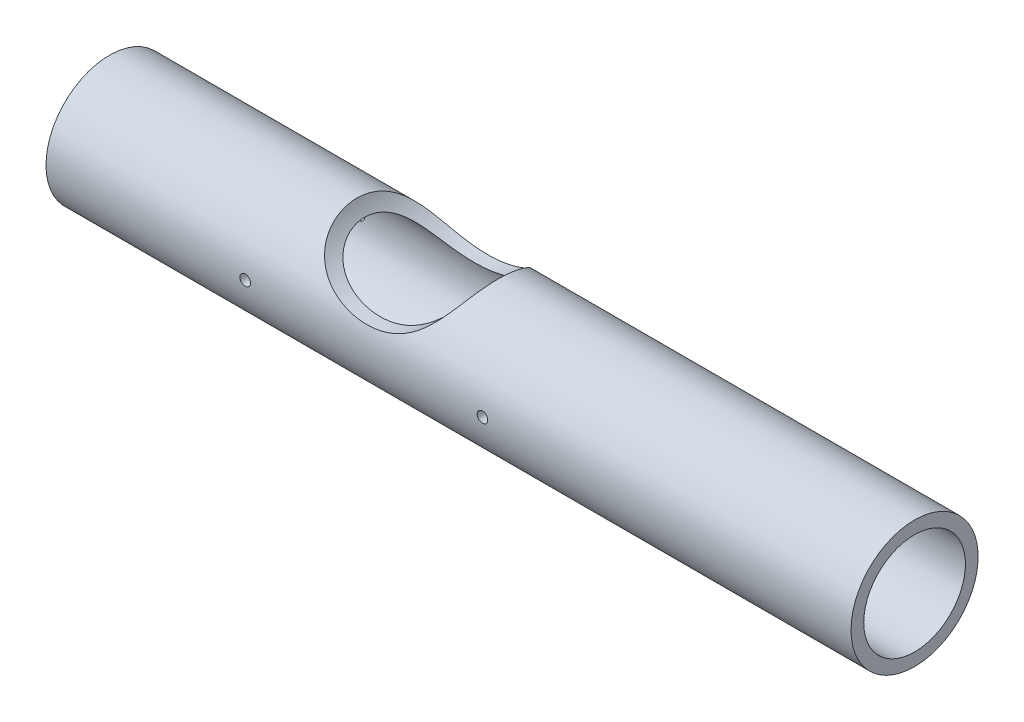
ISO-10303-21;
HEADER;
FILE_DESCRIPTION(('STEP AP214'),'2;1');
FILE_NAME('part.step','',(''),(''),'','','');
FILE_SCHEMA(('AUTOMOTIVE_DESIGN { 1 0 10303 214 1 1 1 1 }'));
ENDSEC;
DATA;
#1=APPLICATION_CONTEXT('core data for automotive mechanical design processes');
#2=APPLICATION_PROTOCOL_DEFINITION('international standard','automotive_design',2000,#1);
#3=PRODUCT_CONTEXT('',#1,'mechanical');
#4=PRODUCT('Part','Part','',(#3));
#5=PRODUCT_RELATED_PRODUCT_CATEGORY('part','',(#4));
#6=PRODUCT_DEFINITION_FORMATION('','',#4);
#7=PRODUCT_DEFINITION_CONTEXT('part definition',#1,'design');
#8=PRODUCT_DEFINITION('design','',#6,#7);
#9=PRODUCT_DEFINITION_SHAPE('','',#8);
#10=(LENGTH_UNIT() NAMED_UNIT(*) SI_UNIT(.MILLI.,.METRE.));
#11=(NAMED_UNIT(*) PLANE_ANGLE_UNIT() SI_UNIT($,.RADIAN.));
#12=(NAMED_UNIT(*) SI_UNIT($,.STERADIAN.) SOLID_ANGLE_UNIT());
#13=UNCERTAINTY_MEASURE_WITH_UNIT(LENGTH_MEASURE(1.E-05),#10,'distance_accuracy_value','');
#14=(GEOMETRIC_REPRESENTATION_CONTEXT(3) GLOBAL_UNCERTAINTY_ASSIGNED_CONTEXT((#13)) GLOBAL_UNIT_ASSIGNED_CONTEXT((#10,
#11,#12)) REPRESENTATION_CONTEXT('',''));
#15=CARTESIAN_POINT('',(0.,0.,0.));
#16=DIRECTION('',(0.,0.,1.));
#17=DIRECTION('',(1.,0.,0.));
#18=AXIS2_PLACEMENT_3D('',#15,#16,#17);
#19=CARTESIAN_POINT('',(-11.8176538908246,15.,0.));
#20=DIRECTION('',(1.,0.,0.));
#21=DIRECTION('',(0.,0.,-1.));
#22=AXIS2_PLACEMENT_3D('',#19,#20,#21);
#23=PLANE('',#22);
#24=CARTESIAN_POINT('',(-11.8176538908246,0.,0.));
#25=DIRECTION('',(-1.,0.,0.));
#26=DIRECTION('',(0.,0.,1.));
#27=AXIS2_PLACEMENT_3D('',#24,#25,#26);
#28=CIRCLE('',#27,12.);
#29=CARTESIAN_POINT('',(-11.8176538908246,0.,12.));
#30=VERTEX_POINT('',#29);
#31=EDGE_CURVE('E10',#30,#30,#28,.T.);
#32=ORIENTED_EDGE('',*,*,#31,.F.);
#33=EDGE_LOOP('',(#32));
#34=FACE_BOUND('',#33,.T.);
#35=CARTESIAN_POINT('',(-11.8176538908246,0.,0.));
#36=DIRECTION('',(-1.,0.,0.));
#37=DIRECTION('',(0.,0.,1.));
#38=AXIS2_PLACEMENT_3D('',#35,#36,#37);
#39=CIRCLE('',#38,15.);
#40=CARTESIAN_POINT('',(-11.8176538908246,0.,15.));
#41=VERTEX_POINT('',#40);
#42=EDGE_CURVE('E139',#41,#41,#39,.T.);
#43=ORIENTED_EDGE('',*,*,#42,.T.);
#44=EDGE_LOOP('',(#43));
#45=FACE_BOUND('',#44,.T.);
#46=ADVANCED_FACE('F33',(#34,#45),#23,.F.);
#47=CARTESIAN_POINT('',(-13.4436701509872,0.,0.));
#48=DIRECTION('',(-1.,0.,0.));
#49=DIRECTION('',(0.,0.,1.));
#50=AXIS2_PLACEMENT_3D('',#47,#48,#49);
#51=CYLINDRICAL_SURFACE('',#50,12.);
#52=CARTESIAN_POINT('',(77.9719297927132,12.,0.));
#53=CARTESIAN_POINT('',(77.9719300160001,11.9999979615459,-0.271083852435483));
#54=CARTESIAN_POINT('',(77.9651008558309,11.9907999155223,-0.542229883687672));
#55=CARTESIAN_POINT('',(77.9377187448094,11.9541287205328,-1.08269862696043));
#56=CARTESIAN_POINT('',(77.917158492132,11.9266458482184,-1.35202029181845));
#57=CARTESIAN_POINT('',(77.862080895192,11.8537331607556,-1.88735842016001));
#58=CARTESIAN_POINT('',(77.8275349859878,11.8082666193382,-2.15336696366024));
#59=CARTESIAN_POINT('',(77.7442319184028,11.7000920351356,-2.67954865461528));
#60=CARTESIAN_POINT('',(77.695476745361,11.6373864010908,-2.93972261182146));
#61=CARTESIAN_POINT('',(77.5834825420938,11.4957751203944,-3.45221278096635));
#62=CARTESIAN_POINT('',(77.5202544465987,11.4168817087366,-3.70453476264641));
#63=CARTESIAN_POINT('',(77.3789733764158,11.2441504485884,-4.19974392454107));
#64=CARTESIAN_POINT('',(77.3009199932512,11.1503121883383,-4.44263084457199));
#65=CARTESIAN_POINT('',(77.1297823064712,10.949348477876,-4.91712334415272));
#66=CARTESIAN_POINT('',(77.0367091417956,10.8422328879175,-5.1487371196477));
#67=CARTESIAN_POINT('',(76.8353263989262,10.6165119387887,-5.59939157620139));
#68=CARTESIAN_POINT('',(76.7270169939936,10.4979067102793,-5.81843240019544));
#69=CARTESIAN_POINT('',(76.4952677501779,10.2514127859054,-6.24248549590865));
#70=CARTESIAN_POINT('',(76.3718434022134,10.1235336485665,-6.44751180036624));
#71=CARTESIAN_POINT('',(76.1099571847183,9.86062900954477,-6.84283217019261));
#72=CARTESIAN_POINT('',(75.9714954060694,9.72560355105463,-7.0331263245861));
#73=CARTESIAN_POINT('',(75.6799094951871,9.45072586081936,-7.3983805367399));
#74=CARTESIAN_POINT('',(75.5267845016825,9.31087334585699,-7.57333969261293));
#75=CARTESIAN_POINT('',(75.2064503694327,9.0286626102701,-7.90766224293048));
#76=CARTESIAN_POINT('',(75.0392397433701,8.88630412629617,-8.06702398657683));
#77=CARTESIAN_POINT('',(74.682212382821,8.59371952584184,-8.37830657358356));
#78=CARTESIAN_POINT('',(74.4916652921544,8.44347922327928,-8.52937563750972));
#79=CARTESIAN_POINT('',(74.0968459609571,8.14514526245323,-8.81471666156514));
#80=CARTESIAN_POINT('',(73.8925735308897,7.99705163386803,-8.94898838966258));
#81=CARTESIAN_POINT('',(73.4713312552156,7.70509013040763,-9.20156928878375));
#82=CARTESIAN_POINT('',(73.2543541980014,7.56122472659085,-9.31986926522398));
#83=CARTESIAN_POINT('',(72.8089947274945,7.27966639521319,-9.54141252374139));
#84=CARTESIAN_POINT('',(72.5806103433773,7.14197454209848,-9.64465319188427));
#85=CARTESIAN_POINT('',(72.0180394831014,6.81958042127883,-9.87660617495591));
#86=CARTESIAN_POINT('',(71.6788050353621,6.63870090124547,-9.99845111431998));
#87=CARTESIAN_POINT('',(70.9832911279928,6.29588262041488,-10.2177935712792));
#88=CARTESIAN_POINT('',(70.6270059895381,6.13395023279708,-10.3152829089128));
#89=CARTESIAN_POINT('',(69.9000391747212,5.83143648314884,-10.4892723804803));
#90=CARTESIAN_POINT('',(69.5293409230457,5.69088067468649,-10.5657474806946));
#91=CARTESIAN_POINT('',(68.7767461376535,5.43319308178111,-10.7005399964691));
#92=CARTESIAN_POINT('',(68.3948503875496,5.31605966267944,-10.7588586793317));
#93=CARTESIAN_POINT('',(67.617154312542,5.10506270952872,-10.8605819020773));
#94=CARTESIAN_POINT('',(67.2212360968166,5.01153305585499,-10.903775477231));
#95=CARTESIAN_POINT('',(66.4228697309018,4.85071273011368,-10.9762635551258));
#96=CARTESIAN_POINT('',(66.0204215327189,4.78342225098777,-11.005557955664));
#97=CARTESIAN_POINT('',(65.2112475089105,4.6756461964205,-11.0517769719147));
#98=CARTESIAN_POINT('',(64.8045216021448,4.63516113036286,-11.06870135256));
#99=CARTESIAN_POINT('',(63.988955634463,4.58130796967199,-11.0910977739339));
#100=CARTESIAN_POINT('',(63.5801154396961,4.56794161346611,-11.0965690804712));
#101=CARTESIAN_POINT('',(62.701311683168,4.56847300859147,-11.0963565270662));
#102=CARTESIAN_POINT('',(62.2313438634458,4.58674344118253,-11.0888835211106));
#103=CARTESIAN_POINT('',(61.2946006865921,4.65909143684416,-11.0586792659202));
#104=CARTESIAN_POINT('',(60.8278258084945,4.71317425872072,-11.0359457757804));
#105=CARTESIAN_POINT('',(59.9007780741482,4.85659584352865,-10.9735862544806));
#106=CARTESIAN_POINT('',(59.4405061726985,4.9459397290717,-10.933957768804));
#107=CARTESIAN_POINT('',(58.5301217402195,5.15884016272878,-10.8351355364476));
#108=CARTESIAN_POINT('',(58.0800071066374,5.28238955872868,-10.7759458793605));
#109=CARTESIAN_POINT('',(57.2698240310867,5.53798134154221,-10.6464799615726));
#110=CARTESIAN_POINT('',(56.9075580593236,5.6649281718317,-10.5798491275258));
#111=CARTESIAN_POINT('',(56.1949727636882,5.93969107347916,-10.4280734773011));
#112=CARTESIAN_POINT('',(55.8446529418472,6.08750627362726,-10.3429294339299));
#113=CARTESIAN_POINT('',(55.1590668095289,6.40178398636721,-10.1514021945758));
#114=CARTESIAN_POINT('',(54.8237801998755,6.56822022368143,-10.0450487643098));
#115=CARTESIAN_POINT('',(54.1706104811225,6.9171712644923,-9.80801690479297));
#116=CARTESIAN_POINT('',(53.8527237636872,7.09968271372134,-9.67734354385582));
#117=CARTESIAN_POINT('',(53.2970431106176,7.44052328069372,-9.41675364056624));
#118=CARTESIAN_POINT('',(53.0556723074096,7.59667784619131,-9.29160500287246));
#119=CARTESIAN_POINT('',(52.5877607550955,7.91469212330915,-9.02225318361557));
#120=CARTESIAN_POINT('',(52.3612183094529,8.07655117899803,-8.87805218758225));
#121=CARTESIAN_POINT('',(51.9245696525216,8.4031315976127,-8.56958534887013));
#122=CARTESIAN_POINT('',(51.7144574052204,8.56785188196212,-8.40532693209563));
#123=CARTESIAN_POINT('',(51.3119666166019,8.89704027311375,-8.0560685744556));
#124=CARTESIAN_POINT('',(51.1195882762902,9.06150837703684,-7.87106839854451));
#125=CARTESIAN_POINT('',(50.752516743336,9.38780529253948,-7.47894227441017));
#126=CARTESIAN_POINT('',(50.5779490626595,9.5496094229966,-7.27167795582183));
#127=CARTESIAN_POINT('',(50.2488171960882,9.8657807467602,-6.83656873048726));
#128=CARTESIAN_POINT('',(50.0942534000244,10.0201477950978,-6.60872342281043));
#129=CARTESIAN_POINT('',(49.8056387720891,10.3177887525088,-6.13366006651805));
#130=CARTESIAN_POINT('',(49.6715850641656,10.4610642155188,-5.88644474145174));
#131=CARTESIAN_POINT('',(49.4240886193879,10.7331346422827,-5.37436938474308));
#132=CARTESIAN_POINT('',(49.3106437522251,10.861931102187,-5.10951118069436));
#133=CARTESIAN_POINT('',(49.1157763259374,11.0885282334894,-4.59504682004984));
#134=CARTESIAN_POINT('',(49.0321875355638,11.1881856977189,-4.34707356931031));
#135=CARTESIAN_POINT('',(48.8808019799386,11.3719389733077,-3.84076954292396));
#136=CARTESIAN_POINT('',(48.8130039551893,11.4560360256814,-3.58243959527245));
#137=CARTESIAN_POINT('',(48.6928577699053,11.6072021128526,-3.05736812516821));
#138=CARTESIAN_POINT('',(48.6405084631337,11.67427241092,-2.79062722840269));
#139=CARTESIAN_POINT('',(48.5509052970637,11.7902673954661,-2.25073882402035));
#140=CARTESIAN_POINT('',(48.5136514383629,11.8391920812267,-1.97759131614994));
#141=CARTESIAN_POINT('',(48.4549510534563,11.9167737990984,-1.43622934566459));
#142=CARTESIAN_POINT('',(48.4330158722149,11.9460560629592,-1.16815708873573));
#143=CARTESIAN_POINT('',(48.402794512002,11.9864955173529,-0.629890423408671));
#144=CARTESIAN_POINT('',(48.39450792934,11.9976532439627,-0.359696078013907));
#145=CARTESIAN_POINT('',(48.3915123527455,12.0016806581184,0.180888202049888));
#146=CARTESIAN_POINT('',(48.3968025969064,11.9945513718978,0.451278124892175));
#147=CARTESIAN_POINT('',(48.4210043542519,11.9621114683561,0.99035482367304));
#148=CARTESIAN_POINT('',(48.4399159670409,11.9368007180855,1.259041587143));
#149=CARTESIAN_POINT('',(48.4915478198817,11.8683303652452,1.79312718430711));
#150=CARTESIAN_POINT('',(48.524284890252,11.8251490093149,2.05852160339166));
#151=CARTESIAN_POINT('',(48.6038168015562,11.7215902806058,2.5837912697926));
#152=CARTESIAN_POINT('',(48.6506115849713,11.6612129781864,2.84366653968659));
#153=CARTESIAN_POINT('',(48.758555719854,11.5242145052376,3.35600703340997));
#154=CARTESIAN_POINT('',(48.8197029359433,11.4475957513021,3.60847335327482));
#155=CARTESIAN_POINT('',(48.9566726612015,11.2793448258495,4.10425456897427));
#156=CARTESIAN_POINT('',(49.0324950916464,11.1877127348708,4.34756951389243));
#157=CARTESIAN_POINT('',(49.1989467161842,10.9911335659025,4.82296901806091));
#158=CARTESIAN_POINT('',(49.2895498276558,10.8862100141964,5.05507244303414));
#159=CARTESIAN_POINT('',(49.4858355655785,10.6647145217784,5.5070131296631));
#160=CARTESIAN_POINT('',(49.5915180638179,10.548142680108,5.72685049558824));
#161=CARTESIAN_POINT('',(49.817983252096,10.3053898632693,6.15297191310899));
#162=CARTESIAN_POINT('',(49.9387639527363,10.1792101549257,6.35925774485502));
#163=CARTESIAN_POINT('',(50.1952888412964,9.91942506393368,6.7573295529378));
#164=CARTESIAN_POINT('',(50.3310332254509,9.78581958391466,6.9491153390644));
#165=CARTESIAN_POINT('',(50.6197658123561,9.51097483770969,7.32091419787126));
#166=CARTESIAN_POINT('',(50.7730250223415,9.36964041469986,7.50064621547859));
#167=CARTESIAN_POINT('',(51.0941164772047,9.08408668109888,7.84405828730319));
#168=CARTESIAN_POINT('',(51.2619488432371,8.93986734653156,8.00773820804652));
#169=CARTESIAN_POINT('',(51.6114573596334,8.65086262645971,8.31911755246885));
#170=CARTESIAN_POINT('',(51.7931368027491,8.50607711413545,8.46681315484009));
#171=CARTESIAN_POINT('',(52.1693877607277,8.21816454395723,8.74654621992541));
#172=CARTESIAN_POINT('',(52.3639598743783,8.07503756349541,8.8785829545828));
#173=CARTESIAN_POINT('',(52.7844873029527,7.77867489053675,9.13974489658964));
#174=CARTESIAN_POINT('',(53.0116544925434,7.62580965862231,9.2673383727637));
#175=CARTESIAN_POINT('',(53.4788747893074,7.32673006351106,9.50555580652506));
#176=CARTESIAN_POINT('',(53.7189286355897,7.18051608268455,9.61617878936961));
#177=CARTESIAN_POINT('',(54.2105978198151,6.89657982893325,9.82180903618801));
#178=CARTESIAN_POINT('',(54.4622178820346,6.7588610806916,9.91680984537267));
#179=CARTESIAN_POINT('',(54.9755675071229,6.493513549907,10.0925521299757));
#180=CARTESIAN_POINT('',(55.2372984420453,6.36588614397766,10.1732916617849));
#181=CARTESIAN_POINT('',(55.8212262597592,6.09828835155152,10.336343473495));
#182=CARTESIAN_POINT('',(56.1452970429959,5.96073222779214,10.4159178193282));
#183=CARTESIAN_POINT('',(56.80387183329,5.70341368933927,10.5590124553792));
#184=CARTESIAN_POINT('',(57.1383769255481,5.58365313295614,10.6225310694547));
#185=CARTESIAN_POINT('',(57.816063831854,5.36305452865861,10.7355959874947));
#186=CARTESIAN_POINT('',(58.1592501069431,5.26222644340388,10.7851349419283));
#187=CARTESIAN_POINT('',(58.8523550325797,5.08041941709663,10.8719580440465));
#188=CARTESIAN_POINT('',(59.202274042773,4.99944153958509,10.9092415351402));
#189=CARTESIAN_POINT('',(59.9789525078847,4.84353568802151,10.979478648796));
#190=CARTESIAN_POINT('',(60.4068590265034,4.77319177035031,11.0100074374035));
#191=CARTESIAN_POINT('',(61.2673386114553,4.66280403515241,11.057207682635));
#192=CARTESIAN_POINT('',(61.699912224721,4.62276380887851,11.0738774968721));
#193=CARTESIAN_POINT('',(62.5674749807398,4.57331718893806,11.0943902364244));
#194=CARTESIAN_POINT('',(63.0024658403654,4.56393642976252,11.098222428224));
#195=CARTESIAN_POINT('',(63.8719456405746,4.57595873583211,11.0932695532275));
#196=CARTESIAN_POINT('',(64.3064345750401,4.59736217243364,11.084484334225));
#197=CARTESIAN_POINT('',(65.2135491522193,4.67427039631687,11.0522917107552));
#198=CARTESIAN_POINT('',(65.685874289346,4.73282315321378,11.0275738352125));
#199=CARTESIAN_POINT('',(66.6234620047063,4.8860230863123,10.9605547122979));
#200=CARTESIAN_POINT('',(67.0887234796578,4.98067584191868,10.9182507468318));
#201=CARTESIAN_POINT('',(68.0081186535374,5.204848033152,10.8131804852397));
#202=CARTESIAN_POINT('',(68.4622594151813,5.33434467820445,10.7504275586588));
#203=CARTESIAN_POINT('',(69.3556037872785,5.6263628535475,10.6005183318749));
#204=CARTESIAN_POINT('',(69.7948122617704,5.78887350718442,10.5133700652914));
#205=CARTESIAN_POINT('',(70.5489826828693,6.10065010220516,10.3346942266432));
#206=CARTESIAN_POINT('',(70.8681108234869,6.24347160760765,10.2494243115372));
#207=CARTESIAN_POINT('',(71.4931922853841,6.54454889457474,10.0598477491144));
#208=CARTESIAN_POINT('',(71.7991468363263,6.70280323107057,9.95554288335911));
#209=CARTESIAN_POINT('',(72.3951818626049,7.03218157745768,9.72567131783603));
#210=CARTESIAN_POINT('',(72.6852839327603,7.20328728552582,9.60013454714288));
#211=CARTESIAN_POINT('',(73.2476709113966,7.55555012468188,9.32542273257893));
#212=CARTESIAN_POINT('',(73.5199587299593,7.7367056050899,9.17625156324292));
#213=CARTESIAN_POINT('',(74.0003265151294,8.07437450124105,8.87953547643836));
#214=CARTESIAN_POINT('',(74.2115145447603,8.22992308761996,8.73591652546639));
#215=CARTESIAN_POINT('',(74.6186077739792,8.5428363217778,8.43017044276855));
#216=CARTESIAN_POINT('',(74.8145145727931,8.70020077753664,8.26804525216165));
#217=CARTESIAN_POINT('',(75.1898363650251,9.01387201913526,7.92490460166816));
#218=CARTESIAN_POINT('',(75.3692563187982,9.17017910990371,7.74389485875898));
#219=CARTESIAN_POINT('',(75.7107283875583,9.47874304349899,7.3629811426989));
#220=CARTESIAN_POINT('',(75.8727802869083,9.63099983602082,7.1630769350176));
#221=CARTESIAN_POINT('',(76.1795244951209,9.92899819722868,6.74398882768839));
#222=CARTESIAN_POINT('',(76.3241357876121,10.0747075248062,6.52472257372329));
#223=CARTESIAN_POINT('',(76.5947785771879,10.3557710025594,6.06874982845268));
#224=CARTESIAN_POINT('',(76.7208095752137,10.4911248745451,5.8320428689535));
#225=CARTESIAN_POINT('',(76.9542800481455,10.7486381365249,5.34259212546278));
#226=CARTESIAN_POINT('',(77.0617084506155,10.8707896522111,5.08983891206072));
#227=CARTESIAN_POINT('',(77.2580499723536,11.0991996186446,4.57036664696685));
#228=CARTESIAN_POINT('',(77.3469649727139,11.205459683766,4.30364901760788));
#229=CARTESIAN_POINT('',(77.4999577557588,11.3917670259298,3.7812705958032));
#230=CARTESIAN_POINT('',(77.5654906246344,11.4732631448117,3.52654992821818));
#231=CARTESIAN_POINT('',(77.6816492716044,11.6197213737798,3.00904996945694));
#232=CARTESIAN_POINT('',(77.7322738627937,11.6846821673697,2.74627003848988));
#233=CARTESIAN_POINT('',(77.8188365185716,11.7968779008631,2.21521532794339));
#234=CARTESIAN_POINT('',(77.8548068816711,11.8441518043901,1.94695401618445));
#235=CARTESIAN_POINT('',(77.9124828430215,11.9204169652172,1.40644295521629));
#236=CARTESIAN_POINT('',(77.9341960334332,11.9494179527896,1.134195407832));
#237=CARTESIAN_POINT('',(77.9565686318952,11.9793706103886,0.717842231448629));
#238=CARTESIAN_POINT('',(77.9623300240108,11.9871029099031,0.574450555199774));
#239=CARTESIAN_POINT('',(77.9700105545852,11.9974181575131,0.287378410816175));
#240=CARTESIAN_POINT('',(77.9719296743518,12.0000010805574,0.143697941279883));
#241=CARTESIAN_POINT('',(77.9719297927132,12.,0.));
#242=B_SPLINE_CURVE_WITH_KNOTS('',3,(#52,#53,#54,#55,#56,#57,#58,#59,#60,#61,#62,#63,#64,#65,
#66,#67,#68,#69,#70,#71,#72,#73,#74,#75,#76,#77,#78,#79,#80,#81,#82,#83,#84,#85,#86,#87,#88,#89,
#90,#91,#92,#93,#94,#95,#96,#97,#98,#99,#100,#101,#102,#103,#104,#105,#106,#107,#108,#109,#110,
#111,#112,#113,#114,#115,#116,#117,#118,#119,#120,#121,#122,#123,#124,#125,#126,#127,#128,#129,
#130,#131,#132,#133,#134,#135,#136,#137,#138,#139,#140,#141,#142,#143,#144,#145,#146,#147,#148,
#149,#150,#151,#152,#153,#154,#155,#156,#157,#158,#159,#160,#161,#162,#163,#164,#165,#166,#167,
#168,#169,#170,#171,#172,#173,#174,#175,#176,#177,#178,#179,#180,#181,#182,#183,#184,#185,#186,
#187,#188,#189,#190,#191,#192,#193,#194,#195,#196,#197,#198,#199,#200,#201,#202,#203,#204,#205,
#206,#207,#208,#209,#210,#211,#212,#213,#214,#215,#216,#217,#218,#219,#220,#221,#222,#223,#224,
#225,#226,#227,#228,#229,#230,#231,#232,#233,#234,#235,#236,#237,#238,#239,#240,#241),
.UNSPECIFIED.,.T.,.F.,(4,2,2,2,2,2,2,2,2,2,2,2,2,2,2,2,2,2,2,2,2,2,2,2,2,2,2,2,2,2,2,2,2,2,2,2,
2,2,2,2,2,2,2,2,2,2,2,2,2,2,2,2,2,2,2,2,2,2,2,2,2,2,2,2,2,2,2,2,2,2,2,2,2,2,2,2,2,2,2,2,2,2,2,2,
2,2,2,2,2,2,2,2,2,2,4),(0.,0.813117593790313,1.62666792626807,2.44188834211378,3.2569949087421,
4.07148765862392,4.8860028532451,5.69991674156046,6.5138213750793,7.32689873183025,
8.13997117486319,8.95309140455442,9.76629760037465,10.622929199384,11.4795726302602,
12.3367071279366,13.1939902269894,14.4021211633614,15.6106573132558,16.8206269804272,
18.030512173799,19.256657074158,20.4828109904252,21.7089882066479,22.9352440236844,
24.3447448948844,25.7544527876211,27.1643655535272,28.5739837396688,29.7417099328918,
30.909387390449,32.0754374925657,33.2412448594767,34.1809625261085,35.1205724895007,
36.0598356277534,36.9991094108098,37.9446014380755,38.8901118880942,39.8354896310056,
40.7807695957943,41.6197770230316,42.4587175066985,43.2975957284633,44.1364739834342,
44.9471919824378,45.7578860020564,46.5685345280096,47.3791889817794,48.190833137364,
49.0024739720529,49.8139941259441,50.6255099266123,51.435608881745,52.2457009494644,
53.0556863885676,53.8656824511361,54.6905611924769,55.515446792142,56.3405291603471,
57.1656498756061,58.0710089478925,58.9764200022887,59.8822042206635,60.7881117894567,
61.8698973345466,62.951795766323,64.0342619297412,65.1167860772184,66.4195879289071,
67.7225441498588,69.0265894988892,70.3306505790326,71.7586629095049,73.1868960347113,
74.6141972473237,76.0410289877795,77.1196940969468,78.1982583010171,79.2753146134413,
80.3521945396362,81.2484037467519,82.1445190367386,83.0403638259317,83.9362197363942,
84.8360887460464,85.7359819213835,86.6364088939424,87.536744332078,88.3618010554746,
89.1869234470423,90.0102172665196,90.83307231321,91.2640930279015,91.6951158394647),.UNSPECIFIED.);
#243=CARTESIAN_POINT('',(77.9719297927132,12.,0.));
#244=VERTEX_POINT('',#243);
#245=EDGE_CURVE('E115',#244,#244,#242,.T.);
#246=ORIENTED_EDGE('',*,*,#245,.T.);
#247=EDGE_LOOP('',(#246));
#248=FACE_BOUND('',#247,.T.);
#249=CARTESIAN_POINT('',(92.4323461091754,0.,12.));
#250=CARTESIAN_POINT('',(92.4323430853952,0.0700095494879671,11.9999991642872));
#251=CARTESIAN_POINT('',(92.4264446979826,0.140065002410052,11.9993808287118));
#252=CARTESIAN_POINT('',(92.4030045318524,0.278232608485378,11.9969736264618));
#253=CARTESIAN_POINT('',(92.3854500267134,0.346342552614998,11.9951834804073));
#254=CARTESIAN_POINT('',(92.3392151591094,0.478598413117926,11.9906346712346));
#255=CARTESIAN_POINT('',(92.3105416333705,0.542746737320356,11.9878766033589));
#256=CARTESIAN_POINT('',(92.2428961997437,0.665306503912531,11.9817001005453));
#257=CARTESIAN_POINT('',(92.2039262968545,0.723719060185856,11.9782817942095));
#258=CARTESIAN_POINT('',(92.116631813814,0.833390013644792,11.9711526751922));
#259=CARTESIAN_POINT('',(92.068275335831,0.884622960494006,11.9674408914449));
#260=CARTESIAN_POINT('',(91.9636484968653,0.978261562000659,11.9601511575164));
#261=CARTESIAN_POINT('',(91.9073777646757,1.02066680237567,11.9565732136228));
#262=CARTESIAN_POINT('',(91.7883594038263,1.09553719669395,11.9499464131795));
#263=CARTESIAN_POINT('',(91.7255971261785,1.12797918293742,11.9468987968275));
#264=CARTESIAN_POINT('',(91.595478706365,1.18185422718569,11.9416898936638));
#265=CARTESIAN_POINT('',(91.5281226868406,1.20328757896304,11.9395285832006));
#266=CARTESIAN_POINT('',(91.3909891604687,1.23446116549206,11.936345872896));
#267=CARTESIAN_POINT('',(91.3212213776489,1.24424374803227,11.9353203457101));
#268=CARTESIAN_POINT('',(91.1810272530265,1.25196903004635,11.9345125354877));
#269=CARTESIAN_POINT('',(91.1106009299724,1.24991206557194,11.9347302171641));
#270=CARTESIAN_POINT('',(90.9713812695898,1.23405152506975,11.9363804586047));
#271=CARTESIAN_POINT('',(90.9025825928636,1.22029424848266,11.9378082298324));
#272=CARTESIAN_POINT('',(90.7682759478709,1.18149567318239,11.9417102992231));
#273=CARTESIAN_POINT('',(90.7027680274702,1.1564542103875,11.9441846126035));
#274=CARTESIAN_POINT('',(90.576756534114,1.09574719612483,11.9499064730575));
#275=CARTESIAN_POINT('',(90.5162628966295,1.06006116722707,11.953155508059));
#276=CARTESIAN_POINT('',(90.4021059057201,0.979092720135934,11.9600594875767));
#277=CARTESIAN_POINT('',(90.348442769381,0.933809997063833,11.9637144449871));
#278=CARTESIAN_POINT('',(90.2492010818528,0.834675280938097,11.9710397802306));
#279=CARTESIAN_POINT('',(90.2036624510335,0.780783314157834,11.97471014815));
#280=CARTESIAN_POINT('',(90.1222720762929,0.666098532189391,11.9816362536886));
#281=CARTESIAN_POINT('',(90.0864203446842,0.605305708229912,11.9848919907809));
#282=CARTESIAN_POINT('',(90.0254228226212,0.478516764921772,11.9906232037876));
#283=CARTESIAN_POINT('',(90.0002791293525,0.412519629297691,11.9930985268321));
#284=CARTESIAN_POINT('',(89.9614410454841,0.277208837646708,11.9969884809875));
#285=CARTESIAN_POINT('',(89.9477462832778,0.207895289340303,11.9984031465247));
#286=CARTESIAN_POINT('',(89.9322456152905,0.068264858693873,12.0000079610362));
#287=CARTESIAN_POINT('',(89.9303846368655,-0.00204584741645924,12.0002037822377));
#288=CARTESIAN_POINT('',(89.9384596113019,-0.141978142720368,11.9993640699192));
#289=CARTESIAN_POINT('',(89.9483953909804,-0.211599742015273,11.9983285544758));
#290=CARTESIAN_POINT('',(89.9797361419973,-0.348018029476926,11.995146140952));
#291=CARTESIAN_POINT('',(90.0011152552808,-0.414820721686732,11.9930017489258));
#292=CARTESIAN_POINT('',(90.0547091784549,-0.543891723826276,11.98784207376));
#293=CARTESIAN_POINT('',(90.0869242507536,-0.606159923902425,11.9848267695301));
#294=CARTESIAN_POINT('',(90.1614116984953,-0.724642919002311,11.9782482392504));
#295=CARTESIAN_POINT('',(90.2037201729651,-0.780834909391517,11.9746830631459));
#296=CARTESIAN_POINT('',(90.2971417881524,-0.885339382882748,11.9674108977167));
#297=CARTESIAN_POINT('',(90.3482551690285,-0.933651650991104,11.9637039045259));
#298=CARTESIAN_POINT('',(90.4580763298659,-1.02121712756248,11.9565487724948));
#299=CARTESIAN_POINT('',(90.5168130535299,-1.06043413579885,11.9531017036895));
#300=CARTESIAN_POINT('',(90.6400711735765,-1.12844682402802,11.9468731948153));
#301=CARTESIAN_POINT('',(90.7045924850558,-1.15724265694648,11.9440917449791));
#302=CARTESIAN_POINT('',(90.8374652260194,-1.2035352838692,11.9395161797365));
#303=CARTESIAN_POINT('',(90.9058091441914,-1.22105344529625,11.9377201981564));
#304=CARTESIAN_POINT('',(91.044488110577,-1.24436270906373,11.9353131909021));
#305=CARTESIAN_POINT('',(91.1148230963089,-1.25015417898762,11.9347021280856));
#306=CARTESIAN_POINT('',(91.2551277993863,-1.24984031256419,11.9347349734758));
#307=CARTESIAN_POINT('',(91.3250976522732,-1.24379184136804,11.9353728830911));
#308=CARTESIAN_POINT('',(91.4630213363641,-1.22008919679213,11.9378189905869));
#309=CARTESIAN_POINT('',(91.530975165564,-1.20243501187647,11.9396271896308));
#310=CARTESIAN_POINT('',(91.6629363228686,-1.15603809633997,11.9442084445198));
#311=CARTESIAN_POINT('',(91.7269443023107,-1.12729720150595,11.9469813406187));
#312=CARTESIAN_POINT('',(91.8492370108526,-1.05954851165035,11.9531798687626));
#313=CARTESIAN_POINT('',(91.9075217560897,-1.02054074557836,11.9566054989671));
#314=CARTESIAN_POINT('',(92.0170048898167,-0.933152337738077,11.9637432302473));
#315=CARTESIAN_POINT('',(92.0681693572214,-0.884729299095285,11.9674565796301));
#316=CARTESIAN_POINT('',(92.1616707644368,-0.779969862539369,11.9747399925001));
#317=CARTESIAN_POINT('',(92.2040055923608,-0.723631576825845,11.9783100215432));
#318=CARTESIAN_POINT('',(92.2787375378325,-0.604472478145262,11.9849147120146));
#319=CARTESIAN_POINT('',(92.3111074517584,-0.541634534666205,11.9879478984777));
#320=CARTESIAN_POINT('',(92.3647926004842,-0.411422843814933,11.9931213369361));
#321=CARTESIAN_POINT('',(92.3861202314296,-0.344054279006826,11.9952625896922));
#322=CARTESIAN_POINT('',(92.4118292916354,-0.230257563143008,11.9978761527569));
#323=CARTESIAN_POINT('',(92.4195125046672,-0.184555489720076,11.998668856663));
#324=CARTESIAN_POINT('',(92.4297719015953,-0.0925756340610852,11.999731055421));
#325=CARTESIAN_POINT('',(92.4323481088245,-0.0462978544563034,12.0000005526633));
#326=CARTESIAN_POINT('',(92.4323461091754,0.,12.));
#327=B_SPLINE_CURVE_WITH_KNOTS('',3,(#249,#250,#251,#252,#253,#254,#255,#256,#257,#258,#259,
#260,#261,#262,#263,#264,#265,#266,#267,#268,#269,#270,#271,#272,#273,#274,#275,#276,#277,#278,
#279,#280,#281,#282,#283,#284,#285,#286,#287,#288,#289,#290,#291,#292,#293,#294,#295,#296,#297,
#298,#299,#300,#301,#302,#303,#304,#305,#306,#307,#308,#309,#310,#311,#312,#313,#314,#315,#316,
#317,#318,#319,#320,#321,#322,#323,#324,#325,#326),.UNSPECIFIED.,.T.,.F.,(4,2,2,2,2,2,2,2,2,2,2,
2,2,2,2,2,2,2,2,2,2,2,2,2,2,2,2,2,2,2,2,2,2,2,2,2,2,2,4),(0.,0.209859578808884,
0.419948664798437,0.629908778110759,0.839828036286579,1.05047354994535,1.26112894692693,
1.47227053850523,1.68340649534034,1.89377265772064,2.10413284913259,2.31366447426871,
2.52319914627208,2.73313953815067,2.94308660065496,3.15403842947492,3.36499052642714,
3.5759839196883,3.78697046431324,3.9969743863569,4.20697522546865,4.41650352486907,
4.62603689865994,4.83633120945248,5.04663125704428,5.25775448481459,5.46887461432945,
5.67959355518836,5.89030589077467,6.10000869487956,6.30971170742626,6.51938001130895,
6.72904772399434,6.93968239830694,7.15036739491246,7.36162255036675,7.57264003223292,
7.71142242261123,7.8502041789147),.UNSPECIFIED.);
#328=CARTESIAN_POINT('',(92.4323461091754,0.,12.));
#329=VERTEX_POINT('',#328);
#330=EDGE_CURVE('E62',#329,#329,#327,.T.);
#331=ORIENTED_EDGE('',*,*,#330,.T.);
#332=EDGE_LOOP('',(#331));
#333=FACE_BOUND('',#332,.T.);
#334=CARTESIAN_POINT('',(92.4323461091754,0.,-12.));
#335=CARTESIAN_POINT('',(92.4323430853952,-0.0700095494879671,-11.9999991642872));
#336=CARTESIAN_POINT('',(92.4264446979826,-0.140065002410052,-11.9993808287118));
#337=CARTESIAN_POINT('',(92.4030045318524,-0.278232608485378,-11.9969736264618));
#338=CARTESIAN_POINT('',(92.3854500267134,-0.346342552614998,-11.9951834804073));
#339=CARTESIAN_POINT('',(92.3392151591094,-0.478598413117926,-11.9906346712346));
#340=CARTESIAN_POINT('',(92.3105416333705,-0.542746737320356,-11.9878766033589));
#341=CARTESIAN_POINT('',(92.2428961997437,-0.665306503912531,-11.9817001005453));
#342=CARTESIAN_POINT('',(92.2039262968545,-0.723719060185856,-11.9782817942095));
#343=CARTESIAN_POINT('',(92.116631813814,-0.833390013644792,-11.9711526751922));
#344=CARTESIAN_POINT('',(92.068275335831,-0.884622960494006,-11.9674408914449));
#345=CARTESIAN_POINT('',(91.9636484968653,-0.978261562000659,-11.9601511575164));
#346=CARTESIAN_POINT('',(91.9073777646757,-1.02066680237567,-11.9565732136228));
#347=CARTESIAN_POINT('',(91.7883594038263,-1.09553719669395,-11.9499464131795));
#348=CARTESIAN_POINT('',(91.7255971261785,-1.12797918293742,-11.9468987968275));
#349=CARTESIAN_POINT('',(91.595478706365,-1.18185422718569,-11.9416898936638));
#350=CARTESIAN_POINT('',(91.5281226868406,-1.20328757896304,-11.9395285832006));
#351=CARTESIAN_POINT('',(91.3909891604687,-1.23446116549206,-11.936345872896));
#352=CARTESIAN_POINT('',(91.3212213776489,-1.24424374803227,-11.9353203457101));
#353=CARTESIAN_POINT('',(91.1810272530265,-1.25196903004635,-11.9345125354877));
#354=CARTESIAN_POINT('',(91.1106009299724,-1.24991206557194,-11.9347302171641));
#355=CARTESIAN_POINT('',(90.9713812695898,-1.23405152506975,-11.9363804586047));
#356=CARTESIAN_POINT('',(90.9025825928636,-1.22029424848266,-11.9378082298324));
#357=CARTESIAN_POINT('',(90.7682759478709,-1.18149567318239,-11.9417102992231));
#358=CARTESIAN_POINT('',(90.7027680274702,-1.1564542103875,-11.9441846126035));
#359=CARTESIAN_POINT('',(90.576756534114,-1.09574719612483,-11.9499064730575));
#360=CARTESIAN_POINT('',(90.5162628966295,-1.06006116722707,-11.953155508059));
#361=CARTESIAN_POINT('',(90.4021059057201,-0.979092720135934,-11.9600594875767));
#362=CARTESIAN_POINT('',(90.348442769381,-0.933809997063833,-11.9637144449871));
#363=CARTESIAN_POINT('',(90.2492010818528,-0.834675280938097,-11.9710397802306));
#364=CARTESIAN_POINT('',(90.2036624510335,-0.780783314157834,-11.97471014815));
#365=CARTESIAN_POINT('',(90.1222720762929,-0.666098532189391,-11.9816362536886));
#366=CARTESIAN_POINT('',(90.0864203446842,-0.605305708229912,-11.9848919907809));
#367=CARTESIAN_POINT('',(90.0254228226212,-0.478516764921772,-11.9906232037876));
#368=CARTESIAN_POINT('',(90.0002791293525,-0.412519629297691,-11.9930985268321));
#369=CARTESIAN_POINT('',(89.9614410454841,-0.277208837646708,-11.9969884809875));
#370=CARTESIAN_POINT('',(89.9477462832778,-0.207895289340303,-11.9984031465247));
#371=CARTESIAN_POINT('',(89.9322456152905,-0.068264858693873,-12.0000079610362));
#372=CARTESIAN_POINT('',(89.9303846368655,0.00204584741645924,-12.0002037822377));
#373=CARTESIAN_POINT('',(89.9384596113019,0.141978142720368,-11.9993640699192));
#374=CARTESIAN_POINT('',(89.9483953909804,0.211599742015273,-11.9983285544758));
#375=CARTESIAN_POINT('',(89.9797361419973,0.348018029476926,-11.995146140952));
#376=CARTESIAN_POINT('',(90.0011152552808,0.414820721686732,-11.9930017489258));
#377=CARTESIAN_POINT('',(90.0547091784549,0.543891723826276,-11.98784207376));
#378=CARTESIAN_POINT('',(90.0869242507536,0.606159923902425,-11.9848267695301));
#379=CARTESIAN_POINT('',(90.1614116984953,0.724642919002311,-11.9782482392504));
#380=CARTESIAN_POINT('',(90.2037201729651,0.780834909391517,-11.9746830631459));
#381=CARTESIAN_POINT('',(90.2971417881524,0.885339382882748,-11.9674108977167));
#382=CARTESIAN_POINT('',(90.3482551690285,0.933651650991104,-11.9637039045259));
#383=CARTESIAN_POINT('',(90.4580763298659,1.02121712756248,-11.9565487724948));
#384=CARTESIAN_POINT('',(90.5168130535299,1.06043413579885,-11.9531017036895));
#385=CARTESIAN_POINT('',(90.6400711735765,1.12844682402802,-11.9468731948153));
#386=CARTESIAN_POINT('',(90.7045924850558,1.15724265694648,-11.9440917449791));
#387=CARTESIAN_POINT('',(90.8374652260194,1.2035352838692,-11.9395161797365));
#388=CARTESIAN_POINT('',(90.9058091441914,1.22105344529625,-11.9377201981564));
#389=CARTESIAN_POINT('',(91.044488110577,1.24436270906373,-11.9353131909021));
#390=CARTESIAN_POINT('',(91.1148230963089,1.25015417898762,-11.9347021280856));
#391=CARTESIAN_POINT('',(91.2551277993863,1.24984031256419,-11.9347349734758));
#392=CARTESIAN_POINT('',(91.3250976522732,1.24379184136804,-11.9353728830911));
#393=CARTESIAN_POINT('',(91.4630213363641,1.22008919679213,-11.9378189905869));
#394=CARTESIAN_POINT('',(91.530975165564,1.20243501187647,-11.9396271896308));
#395=CARTESIAN_POINT('',(91.6629363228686,1.15603809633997,-11.9442084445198));
#396=CARTESIAN_POINT('',(91.7269443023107,1.12729720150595,-11.9469813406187));
#397=CARTESIAN_POINT('',(91.8492370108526,1.05954851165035,-11.9531798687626));
#398=CARTESIAN_POINT('',(91.9075217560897,1.02054074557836,-11.9566054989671));
#399=CARTESIAN_POINT('',(92.0170048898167,0.933152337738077,-11.9637432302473));
#400=CARTESIAN_POINT('',(92.0681693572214,0.884729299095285,-11.9674565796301));
#401=CARTESIAN_POINT('',(92.1616707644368,0.779969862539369,-11.9747399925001));
#402=CARTESIAN_POINT('',(92.2040055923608,0.723631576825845,-11.9783100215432));
#403=CARTESIAN_POINT('',(92.2787375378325,0.604472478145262,-11.9849147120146));
#404=CARTESIAN_POINT('',(92.3111074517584,0.541634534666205,-11.9879478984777));
#405=CARTESIAN_POINT('',(92.3647926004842,0.411422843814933,-11.9931213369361));
#406=CARTESIAN_POINT('',(92.3861202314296,0.344054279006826,-11.9952625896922));
#407=CARTESIAN_POINT('',(92.4118292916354,0.230257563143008,-11.9978761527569));
#408=CARTESIAN_POINT('',(92.4195125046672,0.184555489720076,-11.998668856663));
#409=CARTESIAN_POINT('',(92.4297719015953,0.0925756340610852,-11.999731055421));
#410=CARTESIAN_POINT('',(92.4323481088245,0.0462978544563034,-12.0000005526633));
#411=CARTESIAN_POINT('',(92.4323461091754,0.,-12.));
#412=B_SPLINE_CURVE_WITH_KNOTS('',3,(#334,#335,#336,#337,#338,#339,#340,#341,#342,#343,#344,
#345,#346,#347,#348,#349,#350,#351,#352,#353,#354,#355,#356,#357,#358,#359,#360,#361,#362,#363,
#364,#365,#366,#367,#368,#369,#370,#371,#372,#373,#374,#375,#376,#377,#378,#379,#380,#381,#382,
#383,#384,#385,#386,#387,#388,#389,#390,#391,#392,#393,#394,#395,#396,#397,#398,#399,#400,#401,
#402,#403,#404,#405,#406,#407,#408,#409,#410,#411),.UNSPECIFIED.,.T.,.F.,(4,2,2,2,2,2,2,2,2,2,2,
2,2,2,2,2,2,2,2,2,2,2,2,2,2,2,2,2,2,2,2,2,2,2,2,2,2,2,4),(0.,0.209859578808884,
0.419948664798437,0.629908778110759,0.839828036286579,1.05047354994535,1.26112894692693,
1.47227053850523,1.68340649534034,1.89377265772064,2.10413284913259,2.31366447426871,
2.52319914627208,2.73313953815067,2.94308660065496,3.15403842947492,3.36499052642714,
3.5759839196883,3.78697046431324,3.9969743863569,4.20697522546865,4.41650352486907,
4.62603689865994,4.83633120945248,5.04663125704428,5.25775448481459,5.46887461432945,
5.67959355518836,5.89030589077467,6.10000869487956,6.30971170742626,6.51938001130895,
6.72904772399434,6.93968239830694,7.15036739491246,7.36162255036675,7.57264003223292,
7.71142242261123,7.8502041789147),.UNSPECIFIED.);
#413=CARTESIAN_POINT('',(92.4323461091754,0.,-12.));
#414=VERTEX_POINT('',#413);
#415=EDGE_CURVE('E109',#414,#414,#412,.T.);
#416=ORIENTED_EDGE('',*,*,#415,.T.);
#417=EDGE_LOOP('',(#416));
#418=FACE_BOUND('',#417,.T.);
#419=CARTESIAN_POINT('',(36.4323461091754,0.,12.));
#420=CARTESIAN_POINT('',(36.4323430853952,0.0700095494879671,11.9999991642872));
#421=CARTESIAN_POINT('',(36.4264446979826,0.140065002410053,11.9993808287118));
#422=CARTESIAN_POINT('',(36.4030045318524,0.278232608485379,11.9969736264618));
#423=CARTESIAN_POINT('',(36.3854500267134,0.346342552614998,11.9951834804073));
#424=CARTESIAN_POINT('',(36.3392151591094,0.478598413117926,11.9906346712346));
#425=CARTESIAN_POINT('',(36.3105416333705,0.542746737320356,11.9878766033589));
#426=CARTESIAN_POINT('',(36.2428961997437,0.665306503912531,11.9817001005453));
#427=CARTESIAN_POINT('',(36.2039262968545,0.723719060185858,11.9782817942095));
#428=CARTESIAN_POINT('',(36.116631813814,0.833390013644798,11.9711526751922));
#429=CARTESIAN_POINT('',(36.068275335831,0.884622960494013,11.9674408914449));
#430=CARTESIAN_POINT('',(35.9636484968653,0.978261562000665,11.9601511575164));
#431=CARTESIAN_POINT('',(35.9073777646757,1.02066680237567,11.9565732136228));
#432=CARTESIAN_POINT('',(35.7883594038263,1.09553719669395,11.9499464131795));
#433=CARTESIAN_POINT('',(35.7255971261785,1.12797918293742,11.9468987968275));
#434=CARTESIAN_POINT('',(35.595478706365,1.18185422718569,11.9416898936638));
#435=CARTESIAN_POINT('',(35.5281226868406,1.20328757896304,11.9395285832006));
#436=CARTESIAN_POINT('',(35.3909891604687,1.23446116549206,11.936345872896));
#437=CARTESIAN_POINT('',(35.3212213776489,1.24424374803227,11.9353203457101));
#438=CARTESIAN_POINT('',(35.1810272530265,1.25196903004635,11.9345125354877));
#439=CARTESIAN_POINT('',(35.1106009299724,1.24991206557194,11.9347302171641));
#440=CARTESIAN_POINT('',(34.9713812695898,1.23405152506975,11.9363804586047));
#441=CARTESIAN_POINT('',(34.9025825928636,1.22029424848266,11.9378082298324));
#442=CARTESIAN_POINT('',(34.7682759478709,1.18149567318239,11.9417102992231));
#443=CARTESIAN_POINT('',(34.7027680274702,1.1564542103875,11.9441846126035));
#444=CARTESIAN_POINT('',(34.576756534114,1.09574719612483,11.9499064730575));
#445=CARTESIAN_POINT('',(34.5162628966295,1.06006116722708,11.953155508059));
#446=CARTESIAN_POINT('',(34.4021059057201,0.979092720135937,11.9600594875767));
#447=CARTESIAN_POINT('',(34.348442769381,0.933809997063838,11.9637144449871));
#448=CARTESIAN_POINT('',(34.2492010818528,0.834675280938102,11.9710397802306));
#449=CARTESIAN_POINT('',(34.2036624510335,0.780783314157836,11.97471014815));
#450=CARTESIAN_POINT('',(34.1222720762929,0.666098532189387,11.9816362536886));
#451=CARTESIAN_POINT('',(34.0864203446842,0.605305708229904,11.9848919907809));
#452=CARTESIAN_POINT('',(34.0254228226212,0.478516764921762,11.9906232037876));
#453=CARTESIAN_POINT('',(34.0002791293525,0.412519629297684,11.9930985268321));
#454=CARTESIAN_POINT('',(33.9614410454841,0.277208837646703,11.9969884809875));
#455=CARTESIAN_POINT('',(33.9477462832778,0.207895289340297,11.9984031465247));
#456=CARTESIAN_POINT('',(33.9322456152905,0.068264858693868,12.0000079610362));
#457=CARTESIAN_POINT('',(33.9303846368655,-0.00204584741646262,12.0002037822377));
#458=CARTESIAN_POINT('',(33.9384596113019,-0.141978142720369,11.9993640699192));
#459=CARTESIAN_POINT('',(33.9483953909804,-0.211599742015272,11.9983285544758));
#460=CARTESIAN_POINT('',(33.9797361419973,-0.348018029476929,11.995146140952));
#461=CARTESIAN_POINT('',(34.0011152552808,-0.41482072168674,11.9930017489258));
#462=CARTESIAN_POINT('',(34.0547091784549,-0.543891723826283,11.98784207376));
#463=CARTESIAN_POINT('',(34.0869242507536,-0.606159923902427,11.9848267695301));
#464=CARTESIAN_POINT('',(34.1614116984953,-0.72464291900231,11.9782482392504));
#465=CARTESIAN_POINT('',(34.2037201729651,-0.780834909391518,11.9746830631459));
#466=CARTESIAN_POINT('',(34.2971417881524,-0.88533938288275,11.9674108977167));
#467=CARTESIAN_POINT('',(34.3482551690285,-0.933651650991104,11.9637039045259));
#468=CARTESIAN_POINT('',(34.4580763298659,-1.02121712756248,11.9565487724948));
#469=CARTESIAN_POINT('',(34.5168130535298,-1.06043413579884,11.9531017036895));
#470=CARTESIAN_POINT('',(34.6400711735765,-1.12844682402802,11.9468731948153));
#471=CARTESIAN_POINT('',(34.7045924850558,-1.15724265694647,11.9440917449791));
#472=CARTESIAN_POINT('',(34.8374652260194,-1.2035352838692,11.9395161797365));
#473=CARTESIAN_POINT('',(34.9058091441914,-1.22105344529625,11.9377201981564));
#474=CARTESIAN_POINT('',(35.044488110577,-1.24436270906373,11.9353131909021));
#475=CARTESIAN_POINT('',(35.1148230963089,-1.25015417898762,11.9347021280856));
#476=CARTESIAN_POINT('',(35.2551277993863,-1.24984031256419,11.9347349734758));
#477=CARTESIAN_POINT('',(35.3250976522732,-1.24379184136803,11.9353728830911));
#478=CARTESIAN_POINT('',(35.4630213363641,-1.22008919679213,11.9378189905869));
#479=CARTESIAN_POINT('',(35.530975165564,-1.20243501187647,11.9396271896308));
#480=CARTESIAN_POINT('',(35.6629363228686,-1.15603809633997,11.9442084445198));
#481=CARTESIAN_POINT('',(35.7269443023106,-1.12729720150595,11.9469813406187));
#482=CARTESIAN_POINT('',(35.8492370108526,-1.05954851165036,11.9531798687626));
#483=CARTESIAN_POINT('',(35.9075217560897,-1.02054074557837,11.9566054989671));
#484=CARTESIAN_POINT('',(36.0170048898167,-0.933152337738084,11.9637432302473));
#485=CARTESIAN_POINT('',(36.0681693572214,-0.884729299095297,11.9674565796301));
#486=CARTESIAN_POINT('',(36.1616707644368,-0.779969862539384,11.9747399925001));
#487=CARTESIAN_POINT('',(36.2040055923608,-0.723631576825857,11.9783100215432));
#488=CARTESIAN_POINT('',(36.2787375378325,-0.604472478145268,11.9849147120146));
#489=CARTESIAN_POINT('',(36.3111074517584,-0.541634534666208,11.9879478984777));
#490=CARTESIAN_POINT('',(36.3647926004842,-0.411422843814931,11.9931213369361));
#491=CARTESIAN_POINT('',(36.3861202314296,-0.344054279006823,11.9952625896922));
#492=CARTESIAN_POINT('',(36.4118292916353,-0.230257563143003,11.9978761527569));
#493=CARTESIAN_POINT('',(36.4195125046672,-0.18455548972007,11.998668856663));
#494=CARTESIAN_POINT('',(36.4297719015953,-0.0925756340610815,11.999731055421));
#495=CARTESIAN_POINT('',(36.4323481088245,-0.0462978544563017,12.0000005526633));
#496=CARTESIAN_POINT('',(36.4323461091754,0.,12.));
#497=B_SPLINE_CURVE_WITH_KNOTS('',3,(#419,#420,#421,#422,#423,#424,#425,#426,#427,#428,#429,
#430,#431,#432,#433,#434,#435,#436,#437,#438,#439,#440,#441,#442,#443,#444,#445,#446,#447,#448,
#449,#450,#451,#452,#453,#454,#455,#456,#457,#458,#459,#460,#461,#462,#463,#464,#465,#466,#467,
#468,#469,#470,#471,#472,#473,#474,#475,#476,#477,#478,#479,#480,#481,#482,#483,#484,#485,#486,
#487,#488,#489,#490,#491,#492,#493,#494,#495,#496),.UNSPECIFIED.,.T.,.F.,(4,2,2,2,2,2,2,2,2,2,2,
2,2,2,2,2,2,2,2,2,2,2,2,2,2,2,2,2,2,2,2,2,2,2,2,2,2,2,4),(0.,0.209859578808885,
0.419948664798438,0.629908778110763,0.83982803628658,1.05047354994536,1.26112894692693,
1.47227053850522,1.68340649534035,1.89377265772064,2.10413284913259,2.3136644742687,
2.52319914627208,2.73313953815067,2.94308660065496,3.15403842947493,3.36499052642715,
3.57598391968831,3.78697046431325,3.99697438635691,4.20697522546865,4.41650352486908,
4.62603689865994,4.83633120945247,5.04663125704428,5.25775448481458,5.46887461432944,
5.67959355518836,5.89030589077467,6.10000869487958,6.30971170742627,6.51938001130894,
6.72904772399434,6.93968239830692,7.15036739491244,7.36162255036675,7.57264003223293,
7.71142242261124,7.8502041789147),.UNSPECIFIED.);
#498=CARTESIAN_POINT('',(36.4323461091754,0.,12.));
#499=VERTEX_POINT('',#498);
#500=EDGE_CURVE('E90',#499,#499,#497,.T.);
#501=ORIENTED_EDGE('',*,*,#500,.T.);
#502=EDGE_LOOP('',(#501));
#503=FACE_BOUND('',#502,.T.);
#504=CARTESIAN_POINT('',(36.4323461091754,0.,-12.));
#505=CARTESIAN_POINT('',(36.4323430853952,-0.0700095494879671,-11.9999991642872));
#506=CARTESIAN_POINT('',(36.4264446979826,-0.140065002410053,-11.9993808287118));
#507=CARTESIAN_POINT('',(36.4030045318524,-0.278232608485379,-11.9969736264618));
#508=CARTESIAN_POINT('',(36.3854500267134,-0.346342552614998,-11.9951834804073));
#509=CARTESIAN_POINT('',(36.3392151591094,-0.478598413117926,-11.9906346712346));
#510=CARTESIAN_POINT('',(36.3105416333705,-0.542746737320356,-11.9878766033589));
#511=CARTESIAN_POINT('',(36.2428961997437,-0.665306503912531,-11.9817001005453));
#512=CARTESIAN_POINT('',(36.2039262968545,-0.723719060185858,-11.9782817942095));
#513=CARTESIAN_POINT('',(36.116631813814,-0.833390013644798,-11.9711526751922));
#514=CARTESIAN_POINT('',(36.068275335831,-0.884622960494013,-11.9674408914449));
#515=CARTESIAN_POINT('',(35.9636484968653,-0.978261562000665,-11.9601511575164));
#516=CARTESIAN_POINT('',(35.9073777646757,-1.02066680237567,-11.9565732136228));
#517=CARTESIAN_POINT('',(35.7883594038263,-1.09553719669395,-11.9499464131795));
#518=CARTESIAN_POINT('',(35.7255971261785,-1.12797918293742,-11.9468987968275));
#519=CARTESIAN_POINT('',(35.595478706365,-1.18185422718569,-11.9416898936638));
#520=CARTESIAN_POINT('',(35.5281226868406,-1.20328757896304,-11.9395285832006));
#521=CARTESIAN_POINT('',(35.3909891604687,-1.23446116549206,-11.936345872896));
#522=CARTESIAN_POINT('',(35.3212213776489,-1.24424374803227,-11.9353203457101));
#523=CARTESIAN_POINT('',(35.1810272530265,-1.25196903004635,-11.9345125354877));
#524=CARTESIAN_POINT('',(35.1106009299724,-1.24991206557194,-11.9347302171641));
#525=CARTESIAN_POINT('',(34.9713812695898,-1.23405152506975,-11.9363804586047));
#526=CARTESIAN_POINT('',(34.9025825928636,-1.22029424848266,-11.9378082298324));
#527=CARTESIAN_POINT('',(34.7682759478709,-1.18149567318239,-11.9417102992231));
#528=CARTESIAN_POINT('',(34.7027680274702,-1.1564542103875,-11.9441846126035));
#529=CARTESIAN_POINT('',(34.576756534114,-1.09574719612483,-11.9499064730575));
#530=CARTESIAN_POINT('',(34.5162628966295,-1.06006116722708,-11.953155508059));
#531=CARTESIAN_POINT('',(34.4021059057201,-0.979092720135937,-11.9600594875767));
#532=CARTESIAN_POINT('',(34.348442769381,-0.933809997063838,-11.9637144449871));
#533=CARTESIAN_POINT('',(34.2492010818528,-0.834675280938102,-11.9710397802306));
#534=CARTESIAN_POINT('',(34.2036624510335,-0.780783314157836,-11.97471014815));
#535=CARTESIAN_POINT('',(34.1222720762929,-0.666098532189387,-11.9816362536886));
#536=CARTESIAN_POINT('',(34.0864203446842,-0.605305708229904,-11.9848919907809));
#537=CARTESIAN_POINT('',(34.0254228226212,-0.478516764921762,-11.9906232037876));
#538=CARTESIAN_POINT('',(34.0002791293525,-0.412519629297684,-11.9930985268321));
#539=CARTESIAN_POINT('',(33.9614410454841,-0.277208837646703,-11.9969884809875));
#540=CARTESIAN_POINT('',(33.9477462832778,-0.207895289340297,-11.9984031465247));
#541=CARTESIAN_POINT('',(33.9322456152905,-0.068264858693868,-12.0000079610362));
#542=CARTESIAN_POINT('',(33.9303846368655,0.00204584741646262,-12.0002037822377));
#543=CARTESIAN_POINT('',(33.9384596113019,0.141978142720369,-11.9993640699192));
#544=CARTESIAN_POINT('',(33.9483953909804,0.211599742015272,-11.9983285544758));
#545=CARTESIAN_POINT('',(33.9797361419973,0.348018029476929,-11.995146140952));
#546=CARTESIAN_POINT('',(34.0011152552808,0.41482072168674,-11.9930017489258));
#547=CARTESIAN_POINT('',(34.0547091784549,0.543891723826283,-11.98784207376));
#548=CARTESIAN_POINT('',(34.0869242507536,0.606159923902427,-11.9848267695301));
#549=CARTESIAN_POINT('',(34.1614116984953,0.72464291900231,-11.9782482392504));
#550=CARTESIAN_POINT('',(34.2037201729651,0.780834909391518,-11.9746830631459));
#551=CARTESIAN_POINT('',(34.2971417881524,0.88533938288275,-11.9674108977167));
#552=CARTESIAN_POINT('',(34.3482551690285,0.933651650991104,-11.9637039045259));
#553=CARTESIAN_POINT('',(34.4580763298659,1.02121712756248,-11.9565487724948));
#554=CARTESIAN_POINT('',(34.5168130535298,1.06043413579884,-11.9531017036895));
#555=CARTESIAN_POINT('',(34.6400711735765,1.12844682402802,-11.9468731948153));
#556=CARTESIAN_POINT('',(34.7045924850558,1.15724265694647,-11.9440917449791));
#557=CARTESIAN_POINT('',(34.8374652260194,1.2035352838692,-11.9395161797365));
#558=CARTESIAN_POINT('',(34.9058091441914,1.22105344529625,-11.9377201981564));
#559=CARTESIAN_POINT('',(35.044488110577,1.24436270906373,-11.9353131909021));
#560=CARTESIAN_POINT('',(35.1148230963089,1.25015417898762,-11.9347021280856));
#561=CARTESIAN_POINT('',(35.2551277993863,1.24984031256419,-11.9347349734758));
#562=CARTESIAN_POINT('',(35.3250976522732,1.24379184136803,-11.9353728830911));
#563=CARTESIAN_POINT('',(35.4630213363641,1.22008919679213,-11.9378189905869));
#564=CARTESIAN_POINT('',(35.530975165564,1.20243501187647,-11.9396271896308));
#565=CARTESIAN_POINT('',(35.6629363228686,1.15603809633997,-11.9442084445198));
#566=CARTESIAN_POINT('',(35.7269443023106,1.12729720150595,-11.9469813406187));
#567=CARTESIAN_POINT('',(35.8492370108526,1.05954851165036,-11.9531798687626));
#568=CARTESIAN_POINT('',(35.9075217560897,1.02054074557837,-11.9566054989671));
#569=CARTESIAN_POINT('',(36.0170048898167,0.933152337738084,-11.9637432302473));
#570=CARTESIAN_POINT('',(36.0681693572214,0.884729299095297,-11.9674565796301));
#571=CARTESIAN_POINT('',(36.1616707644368,0.779969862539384,-11.9747399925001));
#572=CARTESIAN_POINT('',(36.2040055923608,0.723631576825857,-11.9783100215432));
#573=CARTESIAN_POINT('',(36.2787375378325,0.604472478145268,-11.9849147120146));
#574=CARTESIAN_POINT('',(36.3111074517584,0.541634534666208,-11.9879478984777));
#575=CARTESIAN_POINT('',(36.3647926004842,0.411422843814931,-11.9931213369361));
#576=CARTESIAN_POINT('',(36.3861202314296,0.344054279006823,-11.9952625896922));
#577=CARTESIAN_POINT('',(36.4118292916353,0.230257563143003,-11.9978761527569));
#578=CARTESIAN_POINT('',(36.4195125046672,0.18455548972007,-11.998668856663));
#579=CARTESIAN_POINT('',(36.4297719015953,0.0925756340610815,-11.999731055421));
#580=CARTESIAN_POINT('',(36.4323481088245,0.0462978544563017,-12.0000005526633));
#581=CARTESIAN_POINT('',(36.4323461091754,0.,-12.));
#582=B_SPLINE_CURVE_WITH_KNOTS('',3,(#504,#505,#506,#507,#508,#509,#510,#511,#512,#513,#514,
#515,#516,#517,#518,#519,#520,#521,#522,#523,#524,#525,#526,#527,#528,#529,#530,#531,#532,#533,
#534,#535,#536,#537,#538,#539,#540,#541,#542,#543,#544,#545,#546,#547,#548,#549,#550,#551,#552,
#553,#554,#555,#556,#557,#558,#559,#560,#561,#562,#563,#564,#565,#566,#567,#568,#569,#570,#571,
#572,#573,#574,#575,#576,#577,#578,#579,#580,#581),.UNSPECIFIED.,.T.,.F.,(4,2,2,2,2,2,2,2,2,2,2,
2,2,2,2,2,2,2,2,2,2,2,2,2,2,2,2,2,2,2,2,2,2,2,2,2,2,2,4),(0.,0.209859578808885,
0.419948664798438,0.629908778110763,0.83982803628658,1.05047354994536,1.26112894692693,
1.47227053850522,1.68340649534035,1.89377265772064,2.10413284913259,2.3136644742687,
2.52319914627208,2.73313953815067,2.94308660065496,3.15403842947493,3.36499052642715,
3.57598391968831,3.78697046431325,3.99697438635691,4.20697522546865,4.41650352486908,
4.62603689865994,4.83633120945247,5.04663125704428,5.25775448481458,5.46887461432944,
5.67959355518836,5.89030589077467,6.10000869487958,6.30971170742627,6.51938001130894,
6.72904772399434,6.93968239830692,7.15036739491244,7.36162255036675,7.57264003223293,
7.71142242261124,7.8502041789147),.UNSPECIFIED.);
#583=CARTESIAN_POINT('',(36.4323461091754,0.,-12.));
#584=VERTEX_POINT('',#583);
#585=EDGE_CURVE('E84',#584,#584,#582,.T.);
#586=ORIENTED_EDGE('',*,*,#585,.T.);
#587=EDGE_LOOP('',(#586));
#588=FACE_BOUND('',#587,.T.);
#589=CARTESIAN_POINT('',(178.182346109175,0.,0.));
#590=DIRECTION('',(-1.,0.,0.));
#591=DIRECTION('',(0.,0.,1.));
#592=AXIS2_PLACEMENT_3D('',#589,#590,#591);
#593=CIRCLE('',#592,12.);
#594=CARTESIAN_POINT('',(178.182346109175,0.,12.));
#595=VERTEX_POINT('',#594);
#596=EDGE_CURVE('E45',#595,#595,#593,.T.);
#597=ORIENTED_EDGE('',*,*,#596,.F.);
#598=EDGE_LOOP('',(#597));
#599=FACE_BOUND('',#598,.T.);
#600=ORIENTED_EDGE('',*,*,#31,.T.);
#601=EDGE_LOOP('',(#600));
#602=FACE_BOUND('',#601,.T.);
#603=ADVANCED_FACE('F99',(#248,#333,#418,#503,#588,#599,#602),#51,.F.);
#604=CARTESIAN_POINT('',(178.182346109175,15.,0.));
#605=DIRECTION('',(-1.,0.,0.));
#606=DIRECTION('',(0.,0.,1.));
#607=AXIS2_PLACEMENT_3D('',#604,#605,#606);
#608=PLANE('',#607);
#609=CARTESIAN_POINT('',(178.182346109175,0.,0.));
#610=DIRECTION('',(-1.,0.,0.));
#611=DIRECTION('',(0.,0.,1.));
#612=AXIS2_PLACEMENT_3D('',#609,#610,#611);
#613=CIRCLE('',#612,15.);
#614=CARTESIAN_POINT('',(178.182346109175,0.,15.));
#615=VERTEX_POINT('',#614);
#616=EDGE_CURVE('E50',#615,#615,#613,.T.);
#617=ORIENTED_EDGE('',*,*,#616,.F.);
#618=EDGE_LOOP('',(#617));
#619=FACE_BOUND('',#618,.T.);
#620=ORIENTED_EDGE('',*,*,#596,.T.);
#621=EDGE_LOOP('',(#620));
#622=FACE_BOUND('',#621,.T.);
#623=ADVANCED_FACE('F102',(#619,#622),#608,.F.);
#624=CARTESIAN_POINT('',(-13.4436701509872,0.,0.));
#625=DIRECTION('',(-1.,0.,0.));
#626=DIRECTION('',(0.,0.,1.));
#627=AXIS2_PLACEMENT_3D('',#624,#625,#626);
#628=CYLINDRICAL_SURFACE('',#627,15.);
#629=CARTESIAN_POINT('',(79.7875195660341,15.,0.));
#630=CARTESIAN_POINT('',(79.787521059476,14.9999976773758,0.370697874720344));
#631=CARTESIAN_POINT('',(79.7809125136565,14.986240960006,0.741503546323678));
#632=CARTESIAN_POINT('',(79.7542921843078,14.9313387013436,1.48075370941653));
#633=CARTESIAN_POINT('',(79.7342728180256,14.8901776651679,1.84919674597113));
#634=CARTESIAN_POINT('',(79.6802213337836,14.7807766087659,2.58188360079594));
#635=CARTESIAN_POINT('',(79.6461574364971,14.712475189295,2.94611595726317));
#636=CARTESIAN_POINT('',(79.5631480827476,14.5495882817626,3.66687439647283));
#637=CARTESIAN_POINT('',(79.5142048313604,14.455006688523,4.0234016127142));
#638=CARTESIAN_POINT('',(79.4002274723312,14.2406134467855,4.72653468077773));
#639=CARTESIAN_POINT('',(79.3351784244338,14.1207783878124,5.07313098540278));
#640=CARTESIAN_POINT('',(79.1876459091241,13.8575213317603,5.75344487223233));
#641=CARTESIAN_POINT('',(79.1051618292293,13.7140985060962,6.08716200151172));
#642=CARTESIAN_POINT('',(78.9213852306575,13.4059096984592,6.7387943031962));
#643=CARTESIAN_POINT('',(78.8201113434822,13.2411649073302,7.05672473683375));
#644=CARTESIAN_POINT('',(78.5972714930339,12.8928453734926,7.67465356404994));
#645=CARTESIAN_POINT('',(78.4757064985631,12.7092715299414,7.97465281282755));
#646=CARTESIAN_POINT('',(78.2149125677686,12.3320703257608,8.54597976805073));
#647=CARTESIAN_POINT('',(78.0763056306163,12.1388951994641,8.8178900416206));
#648=CARTESIAN_POINT('',(77.7779444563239,11.7411337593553,9.34097052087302));
#649=CARTESIAN_POINT('',(77.6181907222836,11.5365477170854,9.59214121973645));
#650=CARTESIAN_POINT('',(77.2771218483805,11.1196984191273,10.0724083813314));
#651=CARTESIAN_POINT('',(77.0958104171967,10.9074364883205,10.3015086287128));
#652=CARTESIAN_POINT('',(76.7116362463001,10.4791043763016,10.7369292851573));
#653=CARTESIAN_POINT('',(76.5087738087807,10.2630342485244,10.9432500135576));
#654=CARTESIAN_POINT('',(76.0894041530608,9.83848166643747,11.3262169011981));
#655=CARTESIAN_POINT('',(75.873610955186,9.62999509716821,11.5036422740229));
#656=CARTESIAN_POINT('',(75.4232936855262,9.21651662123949,11.8375015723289));
#657=CARTESIAN_POINT('',(75.1887701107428,9.01152462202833,11.9939360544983));
#658=CARTESIAN_POINT('',(74.7020972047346,8.60809082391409,12.2866972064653));
#659=CARTESIAN_POINT('',(74.449943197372,8.40965078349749,12.4230185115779));
#660=CARTESIAN_POINT('',(73.9294527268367,8.02212365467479,12.6767183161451));
#661=CARTESIAN_POINT('',(73.6611154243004,7.83303705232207,12.7940958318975));
#662=CARTESIAN_POINT('',(73.0906639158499,7.45386565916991,13.018901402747));
#663=CARTESIAN_POINT('',(72.7874977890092,7.26462074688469,13.1250752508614));
#664=CARTESIAN_POINT('',(72.1663443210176,6.90189611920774,13.319391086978));
#665=CARTESIAN_POINT('',(71.8483564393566,6.72841697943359,13.4075324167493));
#666=CARTESIAN_POINT('',(71.1993523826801,6.39903977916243,13.5678244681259));
#667=CARTESIAN_POINT('',(70.8683308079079,6.24314911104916,13.6399684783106));
#668=CARTESIAN_POINT('',(70.1952525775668,5.9504943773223,13.7701584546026));
#669=CARTESIAN_POINT('',(69.8531952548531,5.81373147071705,13.8282035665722));
#670=CARTESIAN_POINT('',(69.1062950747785,5.54090177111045,13.9399934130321));
#671=CARTESIAN_POINT('',(68.6999120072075,5.40820224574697,13.9916906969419));
#672=CARTESIAN_POINT('',(67.8774700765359,5.17106783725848,14.0810548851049));
#673=CARTESIAN_POINT('',(67.4614103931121,5.06663535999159,14.1187205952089));
#674=CARTESIAN_POINT('',(66.6219655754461,4.88687988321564,14.1819425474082));
#675=CARTESIAN_POINT('',(66.198577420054,4.81156920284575,14.2074936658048));
#676=CARTESIAN_POINT('',(65.3470722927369,4.69069358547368,14.2478573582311));
#677=CARTESIAN_POINT('',(64.9189551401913,4.64512978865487,14.2626695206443));
#678=CARTESIAN_POINT('',(64.0106754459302,4.58054899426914,14.2835540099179));
#679=CARTESIAN_POINT('',(63.530219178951,4.56521098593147,14.2884176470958));
#680=CARTESIAN_POINT('',(62.5695776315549,4.57211178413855,14.2862097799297));
#681=CARTESIAN_POINT('',(62.0893923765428,4.59435366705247,14.2791372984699));
#682=CARTESIAN_POINT('',(61.1322463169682,4.67625269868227,14.2525268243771));
#683=CARTESIAN_POINT('',(60.6552877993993,4.73593404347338,14.2329807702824));
#684=CARTESIAN_POINT('',(59.7082301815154,4.89219427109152,14.1800293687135));
#685=CARTESIAN_POINT('',(59.2381309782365,4.98877259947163,14.1466242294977));
#686=CARTESIAN_POINT('',(58.2974661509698,5.22052550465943,14.0627756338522));
#687=CARTESIAN_POINT('',(57.827139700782,5.35653867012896,14.0119570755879));
#688=CARTESIAN_POINT('',(56.9010296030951,5.66463235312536,13.8902612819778));
#689=CARTESIAN_POINT('',(56.4452472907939,5.83671617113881,13.8193822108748));
#690=CARTESIAN_POINT('',(55.5529136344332,6.21435275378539,13.65372714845));
#691=CARTESIAN_POINT('',(55.1163388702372,6.41986323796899,13.5589812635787));
#692=CARTESIAN_POINT('',(54.2661967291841,6.86112854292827,13.3411164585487));
#693=CARTESIAN_POINT('',(53.8526220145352,7.09687363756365,13.218006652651));
#694=CARTESIAN_POINT('',(53.1467246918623,7.53558549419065,12.971602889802));
#695=CARTESIAN_POINT('',(52.8487153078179,7.73327053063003,12.8551253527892));
#696=CARTESIAN_POINT('',(52.2706941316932,8.14090828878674,12.6009239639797));
#697=CARTESIAN_POINT('',(51.990679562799,8.35085910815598,12.4632034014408));
#698=CARTESIAN_POINT('',(51.4506779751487,8.7796436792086,12.1649486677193));
#699=CARTESIAN_POINT('',(51.190675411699,8.99847033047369,12.0044324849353));
#700=CARTESIAN_POINT('',(50.6920307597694,9.44142260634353,11.6592601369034));
#701=CARTESIAN_POINT('',(50.4533891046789,9.66554833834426,11.4746034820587));
#702=CARTESIAN_POINT('',(49.9976697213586,10.1159324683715,11.0796204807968));
#703=CARTESIAN_POINT('',(49.7806924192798,10.3421959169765,10.8691838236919));
#704=CARTESIAN_POINT('',(49.3702257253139,10.7914082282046,10.4233213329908));
#705=CARTESIAN_POINT('',(49.1767364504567,11.0143570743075,10.1878953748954));
#706=CARTESIAN_POINT('',(48.8133586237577,11.4524880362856,9.69277037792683));
#707=CARTESIAN_POINT('',(48.6434732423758,11.6676691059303,9.43306808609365));
#708=CARTESIAN_POINT('',(48.326898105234,12.0859594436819,8.89082698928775));
#709=CARTESIAN_POINT('',(48.1802073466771,12.2890692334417,8.60828917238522));
#710=CARTESIAN_POINT('',(47.919123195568,12.664901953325,8.04403782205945));
#711=CARTESIAN_POINT('',(47.8031428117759,12.8387612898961,7.76381149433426));
#712=CARTESIAN_POINT('',(47.5892393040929,13.1701619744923,7.18730587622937));
#713=CARTESIAN_POINT('',(47.4913151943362,13.3277042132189,6.89102746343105));
#714=CARTESIAN_POINT('',(47.3123359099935,13.6242558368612,6.28439850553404));
#715=CARTESIAN_POINT('',(47.2312828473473,13.7632629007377,5.97404620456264));
#716=CARTESIAN_POINT('',(47.0848405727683,14.0209093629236,5.34141983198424));
#717=CARTESIAN_POINT('',(47.0194519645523,14.1395479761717,5.01914530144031));
#718=CARTESIAN_POINT('',(46.901652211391,14.3578594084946,4.35624025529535));
#719=CARTESIAN_POINT('',(46.8496274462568,14.4569516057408,4.01534990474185));
#720=CARTESIAN_POINT('',(46.7597554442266,14.6310156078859,3.3256420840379));
#721=CARTESIAN_POINT('',(46.7219083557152,14.7059871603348,2.97682453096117));
#722=CARTESIAN_POINT('',(46.6595068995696,14.8310063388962,2.27351022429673));
#723=CARTESIAN_POINT('',(46.6349552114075,14.8810489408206,1.91901234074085));
#724=CARTESIAN_POINT('',(46.5985498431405,14.9556723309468,1.20669777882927));
#725=CARTESIAN_POINT('',(46.5866965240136,14.9802523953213,0.848881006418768));
#726=CARTESIAN_POINT('',(46.5751162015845,15.0042570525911,0.115214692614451));
#727=CARTESIAN_POINT('',(46.5759904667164,15.0024343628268,-0.260685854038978));
#728=CARTESIAN_POINT('',(46.5913599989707,14.9705995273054,-1.0110214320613));
#729=CARTESIAN_POINT('',(46.6058557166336,14.9405864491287,-1.38545641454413));
#730=CARTESIAN_POINT('',(46.6488781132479,14.8526927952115,-2.13029555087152));
#731=CARTESIAN_POINT('',(46.6774070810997,14.7948076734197,-2.50069903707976));
#732=CARTESIAN_POINT('',(46.7492623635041,14.6518301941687,-3.2347624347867));
#733=CARTESIAN_POINT('',(46.7925885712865,14.5667380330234,-3.59842239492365));
#734=CARTESIAN_POINT('',(46.8954732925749,14.3697051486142,-4.31879064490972));
#735=CARTESIAN_POINT('',(46.9551410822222,14.257584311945,-4.67543416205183));
#736=CARTESIAN_POINT('',(47.0919364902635,14.0082981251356,-5.37642586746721));
#737=CARTESIAN_POINT('',(47.16906425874,13.8711325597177,-5.72077395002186));
#738=CARTESIAN_POINT('',(47.3422555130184,13.573819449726,-6.39428317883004));
#739=CARTESIAN_POINT('',(47.4383105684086,13.4136821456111,-6.7234510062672));
#740=CARTESIAN_POINT('',(47.6509112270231,13.0729354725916,-7.36409977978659));
#741=CARTESIAN_POINT('',(47.7674557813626,12.8923271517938,-7.67558163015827));
#742=CARTESIAN_POINT('',(48.0172838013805,12.5214219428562,-8.26623638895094));
#743=CARTESIAN_POINT('',(48.1497018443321,12.3318102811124,-8.54620590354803));
#744=CARTESIAN_POINT('',(48.4356687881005,11.9398867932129,-9.08571744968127));
#745=CARTESIAN_POINT('',(48.5892169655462,11.7375754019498,-9.34526018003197));
#746=CARTESIAN_POINT('',(48.9179810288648,11.3239815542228,-9.84235537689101));
#747=CARTESIAN_POINT('',(49.0931889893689,11.1127023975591,-10.079915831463));
#748=CARTESIAN_POINT('',(49.4654448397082,10.6850196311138,-10.5321998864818));
#749=CARTESIAN_POINT('',(49.6624923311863,10.4686161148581,-10.7469239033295));
#750=CARTESIAN_POINT('',(50.0697968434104,10.0433005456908,-11.1451159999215));
#751=CARTESIAN_POINT('',(50.2792193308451,9.83443200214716,-11.3294862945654));
#752=CARTESIAN_POINT('',(50.7171090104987,9.41910549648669,-11.6770626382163));
#753=CARTESIAN_POINT('',(50.9455756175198,9.21264746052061,-11.840269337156));
#754=CARTESIAN_POINT('',(51.420540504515,8.80529601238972,-12.1462625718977));
#755=CARTESIAN_POINT('',(51.6670435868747,8.60440410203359,-12.2890436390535));
#756=CARTESIAN_POINT('',(52.1767023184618,8.21111167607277,-12.5552399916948));
#757=CARTESIAN_POINT('',(52.4398587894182,8.01871158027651,-12.6786543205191));
#758=CARTESIAN_POINT('',(52.9973920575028,7.63380551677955,-12.9142915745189));
#759=CARTESIAN_POINT('',(53.2926948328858,7.44196987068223,-13.0254168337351));
#760=CARTESIAN_POINT('',(53.8984404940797,7.0730835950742,-13.2293584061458));
#761=CARTESIAN_POINT('',(54.2088838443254,6.89603341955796,-13.3221741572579));
#762=CARTESIAN_POINT('',(54.8431574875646,6.55862495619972,-13.4914822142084));
#763=CARTESIAN_POINT('',(55.1669931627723,6.39827347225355,-13.5679678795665));
#764=CARTESIAN_POINT('',(55.8260982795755,6.09589074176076,-13.7064864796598));
#765=CARTESIAN_POINT('',(56.1613684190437,5.95386061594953,-13.7685185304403));
#766=CARTESIAN_POINT('',(56.8932172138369,5.66923926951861,-13.888379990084));
#767=CARTESIAN_POINT('',(57.2913772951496,5.52983517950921,-13.9441423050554));
#768=CARTESIAN_POINT('',(58.097931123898,5.27828944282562,-14.0412903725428));
#769=CARTESIAN_POINT('',(58.5063257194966,5.16615006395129,-14.0826749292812));
#770=CARTESIAN_POINT('',(59.3310514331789,4.97005147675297,-14.1530722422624));
#771=CARTESIAN_POINT('',(59.7473858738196,4.88610435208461,-14.1820796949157));
#772=CARTESIAN_POINT('',(60.5854552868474,4.74709877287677,-14.2292102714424));
#773=CARTESIAN_POINT('',(61.0071904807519,4.69204150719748,-14.2473329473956));
#774=CARTESIAN_POINT('',(61.9056821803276,4.60625839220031,-14.2753187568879));
#775=CARTESIAN_POINT('',(62.3828469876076,4.57934180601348,-14.2838973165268));
#776=CARTESIAN_POINT('',(63.3379163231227,4.56265366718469,-14.2892354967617));
#777=CARTESIAN_POINT('',(63.8158209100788,4.57288523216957,-14.28599412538));
#778=CARTESIAN_POINT('',(64.7694737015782,4.63042922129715,-14.2674470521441));
#779=CARTESIAN_POINT('',(65.2452203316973,4.67776535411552,-14.25213363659));
#780=CARTESIAN_POINT('',(66.1910091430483,4.80913217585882,-14.2083437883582));
#781=CARTESIAN_POINT('',(66.6610513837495,4.8931624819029,-14.1798674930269));
#782=CARTESIAN_POINT('',(67.6062005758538,5.10021456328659,-14.1067446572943));
#783=CARTESIAN_POINT('',(68.0810316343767,5.22433745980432,-14.0616356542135));
#784=CARTESIAN_POINT('',(69.0173828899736,5.5093280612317,-13.9524398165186));
#785=CARTESIAN_POINT('',(69.4789018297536,5.67019922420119,-13.8883511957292));
#786=CARTESIAN_POINT('',(70.3840659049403,6.02639423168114,-13.7375370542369));
#787=CARTESIAN_POINT('',(70.8277301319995,6.22168000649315,-13.6508364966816));
#788=CARTESIAN_POINT('',(71.6933950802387,6.6437939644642,-13.4504472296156));
#789=CARTESIAN_POINT('',(72.1154022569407,6.87061267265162,-13.336766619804));
#790=CARTESIAN_POINT('',(72.8409775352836,7.29720751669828,-13.1070741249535));
#791=CARTESIAN_POINT('',(73.1497755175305,7.49152813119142,-12.9973827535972));
#792=CARTESIAN_POINT('',(73.7497104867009,7.89394286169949,-12.7569815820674));
#793=CARTESIAN_POINT('',(74.0408500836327,8.10203493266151,-12.6262748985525));
#794=CARTESIAN_POINT('',(74.6032903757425,8.52870684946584,-12.3420736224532));
#795=CARTESIAN_POINT('',(74.8746065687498,8.74727827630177,-12.1885971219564));
#796=CARTESIAN_POINT('',(75.395897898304,9.19137316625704,-11.8572920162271));
#797=CARTESIAN_POINT('',(75.6458726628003,9.41689675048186,-11.6794629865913));
#798=CARTESIAN_POINT('',(76.1242648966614,9.87186044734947,-11.2975657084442));
#799=CARTESIAN_POINT('',(76.3525668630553,10.1013146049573,-11.0933692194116));
#800=CARTESIAN_POINT('',(76.7852298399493,10.5584403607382,-10.6592059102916));
#801=CARTESIAN_POINT('',(76.9895907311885,10.7861119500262,-10.4292389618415));
#802=CARTESIAN_POINT('',(77.3740034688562,11.2349675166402,-9.94407837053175));
#803=CARTESIAN_POINT('',(77.5540570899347,11.4561519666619,-9.68888657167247));
#804=CARTESIAN_POINT('',(77.8901322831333,11.88750262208,-9.15451520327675));
#805=CARTESIAN_POINT('',(78.0461552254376,12.0976694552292,-8.87533700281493));
#806=CARTESIAN_POINT('',(78.3228305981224,12.4857496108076,-8.31932456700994));
#807=CARTESIAN_POINT('',(78.4453550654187,12.6648886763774,-8.04427217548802));
#808=CARTESIAN_POINT('',(78.6719022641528,13.0076205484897,-7.47739880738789));
#809=CARTESIAN_POINT('',(78.7759259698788,13.1712141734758,-7.1855787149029));
#810=CARTESIAN_POINT('',(78.9666850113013,13.4805725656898,-6.58693971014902));
#811=CARTESIAN_POINT('',(79.0534079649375,13.6263245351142,-6.28011024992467));
#812=CARTESIAN_POINT('',(79.2106990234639,13.8978945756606,-5.65376432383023));
#813=CARTESIAN_POINT('',(79.2812670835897,14.0237125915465,-5.33424782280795));
#814=CARTESIAN_POINT('',(79.40872185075,14.256176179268,-4.67814148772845));
#815=CARTESIAN_POINT('',(79.4653035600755,14.3623833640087,-4.34133718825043));
#816=CARTESIAN_POINT('',(79.5640568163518,14.5511718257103,-3.65905819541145));
#817=CARTESIAN_POINT('',(79.6062262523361,14.6337496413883,-3.31358223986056));
#818=CARTESIAN_POINT('',(79.6770202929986,14.7742063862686,-2.61702672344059));
#819=CARTESIAN_POINT('',(79.705671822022,14.8321343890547,-2.26595975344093));
#820=CARTESIAN_POINT('',(79.7502348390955,14.9229073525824,-1.55993766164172));
#821=CARTESIAN_POINT('',(79.7661529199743,14.9557652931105,-1.20498464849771));
#822=CARTESIAN_POINT('',(79.7797826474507,14.9839575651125,-0.707874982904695));
#823=CARTESIAN_POINT('',(79.7826851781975,14.9899719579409,-0.56638721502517));
#824=CARTESIAN_POINT('',(79.7865533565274,14.9979936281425,-0.283271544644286));
#825=CARTESIAN_POINT('',(79.7875189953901,15.0000008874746,-0.141643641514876));
#826=CARTESIAN_POINT('',(79.7875195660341,15.,0.));
#827=B_SPLINE_CURVE_WITH_KNOTS('',3,(#629,#630,#631,#632,#633,#634,#635,#636,#637,#638,#639,
#640,#641,#642,#643,#644,#645,#646,#647,#648,#649,#650,#651,#652,#653,#654,#655,#656,#657,#658,
#659,#660,#661,#662,#663,#664,#665,#666,#667,#668,#669,#670,#671,#672,#673,#674,#675,#676,#677,
#678,#679,#680,#681,#682,#683,#684,#685,#686,#687,#688,#689,#690,#691,#692,#693,#694,#695,#696,
#697,#698,#699,#700,#701,#702,#703,#704,#705,#706,#707,#708,#709,#710,#711,#712,#713,#714,#715,
#716,#717,#718,#719,#720,#721,#722,#723,#724,#725,#726,#727,#728,#729,#730,#731,#732,#733,#734,
#735,#736,#737,#738,#739,#740,#741,#742,#743,#744,#745,#746,#747,#748,#749,#750,#751,#752,#753,
#754,#755,#756,#757,#758,#759,#760,#761,#762,#763,#764,#765,#766,#767,#768,#769,#770,#771,#772,
#773,#774,#775,#776,#777,#778,#779,#780,#781,#782,#783,#784,#785,#786,#787,#788,#789,#790,#791,
#792,#793,#794,#795,#796,#797,#798,#799,#800,#801,#802,#803,#804,#805,#806,#807,#808,#809,#810,
#811,#812,#813,#814,#815,#816,#817,#818,#819,#820,#821,#822,#823,#824,#825,#826),.UNSPECIFIED.,
.T.,.F.,(4,2,2,2,2,2,2,2,2,2,2,2,2,2,2,2,2,2,2,2,2,2,2,2,2,2,2,2,2,2,2,2,2,2,2,2,2,2,2,2,2,2,2,
2,2,2,2,2,2,2,2,2,2,2,2,2,2,2,2,2,2,2,2,2,2,2,2,2,2,2,2,2,2,2,2,2,2,2,2,2,2,2,2,2,2,2,2,2,2,2,2,
2,2,2,2,2,2,2,4),(0.,1.11196612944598,2.22456151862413,3.33968837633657,4.45465005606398,
5.57064991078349,6.68668897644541,7.80162726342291,8.91651233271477,9.99872752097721,
11.0809169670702,12.1629205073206,13.2449088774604,14.2894975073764,15.3340584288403,
16.3788974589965,17.4237907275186,18.5411351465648,19.6585203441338,20.7763734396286,
21.8942942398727,23.1848076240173,24.4754308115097,25.7665993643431,27.0578174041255,
28.4983452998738,29.9389911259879,31.3805689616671,32.8221251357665,34.2969200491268,
35.7718499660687,37.2449285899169,38.7175345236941,39.8447279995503,40.9717471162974,
42.0978817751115,43.2240392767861,44.3551958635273,45.4863580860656,46.6176720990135,
47.748937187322,48.7964603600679,49.843926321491,50.8915233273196,51.9391607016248,
53.0143409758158,54.0895325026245,55.1649406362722,56.2403793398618,57.3667816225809,
58.493221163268,59.6198444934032,60.7464596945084,61.8808006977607,63.0151514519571,
64.1489980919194,65.2827867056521,66.3708157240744,67.4588075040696,68.5464023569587,
69.6339773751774,70.6783926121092,71.7227757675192,72.7674380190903,73.8121518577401,
74.9188184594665,76.0255190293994,77.1326687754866,78.2398862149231,79.5151654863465,
80.7905507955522,82.0664820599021,83.3424658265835,84.7748406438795,86.2073356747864,
87.6407467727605,89.0741429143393,90.55083682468,92.0276697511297,93.5028791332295,
94.9776462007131,96.1194649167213,97.2611144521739,98.4018616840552,99.5426287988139,
100.689169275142,101.835715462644,102.982177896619,104.128574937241,105.17844707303,
106.228263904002,107.2788294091,108.329397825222,109.40117754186,110.473114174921,
111.542906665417,112.612144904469,113.037025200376,113.461907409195),.UNSPECIFIED.);
#828=CARTESIAN_POINT('',(79.7875195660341,15.,0.));
#829=VERTEX_POINT('',#828);
#830=EDGE_CURVE('E36',#829,#829,#827,.T.);
#831=ORIENTED_EDGE('',*,*,#830,.T.);
#832=EDGE_LOOP('',(#831));
#833=FACE_BOUND('',#832,.T.);
#834=CARTESIAN_POINT('',(92.4323461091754,0.,15.));
#835=CARTESIAN_POINT('',(92.4323430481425,-0.0700826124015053,14.9999993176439));
#836=CARTESIAN_POINT('',(92.4264323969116,-0.140212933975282,14.9995036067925));
#837=CARTESIAN_POINT('',(92.4029406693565,-0.278533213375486,14.9975737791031));
#838=CARTESIAN_POINT('',(92.3853463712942,-0.346720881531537,14.9961385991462));
#839=CARTESIAN_POINT('',(92.3389996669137,-0.479132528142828,14.9924920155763));
#840=CARTESIAN_POINT('',(92.3102535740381,-0.543358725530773,14.9902810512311));
#841=CARTESIAN_POINT('',(92.2424305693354,-0.666059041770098,14.9853308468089));
#842=CARTESIAN_POINT('',(92.2033558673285,-0.724534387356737,14.982591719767));
#843=CARTESIAN_POINT('',(92.1158772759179,-0.834237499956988,14.9768847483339));
#844=CARTESIAN_POINT('',(92.0674525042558,-0.885448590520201,14.9739164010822));
#845=CARTESIAN_POINT('',(91.962692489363,-0.97902641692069,14.9680897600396));
#846=CARTESIAN_POINT('',(91.9063568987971,-1.02139276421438,14.965231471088));
#847=CARTESIAN_POINT('',(91.7872734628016,-1.09613490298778,14.9599431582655));
#848=CARTESIAN_POINT('',(91.7245163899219,-1.12849604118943,14.9575137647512));
#849=CARTESIAN_POINT('',(91.5944357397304,-1.1822155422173,14.9533640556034));
#850=CARTESIAN_POINT('',(91.5271122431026,-1.20357409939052,14.9516437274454));
#851=CARTESIAN_POINT('',(91.3899768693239,-1.23463378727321,14.949111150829));
#852=CARTESIAN_POINT('',(91.3201711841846,-1.24436208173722,14.9482967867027));
#853=CARTESIAN_POINT('',(91.1799133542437,-1.25196901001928,14.9476616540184));
#854=CARTESIAN_POINT('',(91.1094612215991,-1.24984786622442,14.9478408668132));
#855=CARTESIAN_POINT('',(90.9700965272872,-1.23383858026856,14.9491707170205));
#856=CARTESIAN_POINT('',(90.9011805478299,-1.21997996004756,14.9503189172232));
#857=CARTESIAN_POINT('',(90.7666562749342,-1.18093498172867,14.9534535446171));
#858=CARTESIAN_POINT('',(90.7010480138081,-1.15574851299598,14.955439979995));
#859=CARTESIAN_POINT('',(90.5749074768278,-1.09472973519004,14.9600300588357));
#860=CARTESIAN_POINT('',(90.514381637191,-1.05888418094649,14.962634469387));
#861=CARTESIAN_POINT('',(90.4001944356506,-0.977574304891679,14.9681663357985));
#862=CARTESIAN_POINT('',(90.3465332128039,-0.93210978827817,14.9710937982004));
#863=CARTESIAN_POINT('',(90.2474268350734,-0.832686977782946,14.9769527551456));
#864=CARTESIAN_POINT('',(90.2020072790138,-0.778703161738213,14.9798842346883));
#865=CARTESIAN_POINT('',(90.1208714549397,-0.663863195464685,14.9854123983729));
#866=CARTESIAN_POINT('',(90.0851551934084,-0.603007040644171,14.9880090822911));
#867=CARTESIAN_POINT('',(90.0244414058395,-0.476133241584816,14.9925755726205));
#868=CARTESIAN_POINT('',(89.9994450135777,-0.410115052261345,14.994545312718));
#869=CARTESIAN_POINT('',(89.9608984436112,-0.274798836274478,14.9976352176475));
#870=CARTESIAN_POINT('',(89.9473480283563,-0.205500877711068,14.9987554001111));
#871=CARTESIAN_POINT('',(89.9321101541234,-0.0658141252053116,15.0000177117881));
#872=CARTESIAN_POINT('',(89.9303873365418,0.00457078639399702,15.00016275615));
#873=CARTESIAN_POINT('',(89.9387609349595,0.144628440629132,14.9994662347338));
#874=CARTESIAN_POINT('',(89.9488572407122,0.21430118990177,14.9986246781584));
#875=CARTESIAN_POINT('',(89.980553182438,0.350855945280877,14.9960514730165));
#876=CARTESIAN_POINT('',(90.0021364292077,0.417741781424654,14.9943210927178));
#877=CARTESIAN_POINT('',(90.0561768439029,0.546942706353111,14.9901646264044));
#878=CARTESIAN_POINT('',(90.0886341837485,0.609257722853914,14.9877385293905));
#879=CARTESIAN_POINT('',(90.1635902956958,0.727709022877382,14.9824553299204));
#880=CARTESIAN_POINT('',(90.2061124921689,0.783830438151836,14.9795972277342));
#881=CARTESIAN_POINT('',(90.2999574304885,0.888151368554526,14.9737744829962));
#882=CARTESIAN_POINT('',(90.351280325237,0.936350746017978,14.9708098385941));
#883=CARTESIAN_POINT('',(90.4614232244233,1.02358068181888,14.9650995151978));
#884=CARTESIAN_POINT('',(90.5202615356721,1.06258816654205,14.9623543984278));
#885=CARTESIAN_POINT('',(90.6436739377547,1.1301688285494,14.957401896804));
#886=CARTESIAN_POINT('',(90.7082479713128,1.15874211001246,14.9551945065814));
#887=CARTESIAN_POINT('',(90.8412170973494,1.2046039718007,14.9515705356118));
#888=CARTESIAN_POINT('',(90.9096072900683,1.22190667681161,14.9501529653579));
#889=CARTESIAN_POINT('',(91.0483344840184,1.24478221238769,14.9482658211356));
#890=CARTESIAN_POINT('',(91.1186714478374,1.25035526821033,14.9477962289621));
#891=CARTESIAN_POINT('',(91.2590662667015,1.24961070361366,14.9478584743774));
#892=CARTESIAN_POINT('',(91.3291243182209,1.24332933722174,14.9483872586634));
#893=CARTESIAN_POINT('',(91.467186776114,1.21912982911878,14.9503801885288));
#894=CARTESIAN_POINT('',(91.5351911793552,1.20121166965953,14.9518443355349));
#895=CARTESIAN_POINT('',(91.6672183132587,1.15425638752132,14.9555422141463));
#896=CARTESIAN_POINT('',(91.7312412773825,1.12521991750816,14.9577759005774));
#897=CARTESIAN_POINT('',(91.8535096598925,1.05685632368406,14.9627612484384));
#898=CARTESIAN_POINT('',(91.911755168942,1.01752936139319,14.9655129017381));
#899=CARTESIAN_POINT('',(92.0210007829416,0.929564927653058,14.9712341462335));
#900=CARTESIAN_POINT('',(92.0719792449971,0.880900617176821,14.9742043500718));
#901=CARTESIAN_POINT('',(92.1650650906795,0.775691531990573,14.980022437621));
#902=CARTESIAN_POINT('',(92.2071703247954,0.719144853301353,14.9828702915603));
#903=CARTESIAN_POINT('',(92.2813709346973,0.599667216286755,14.9881279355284));
#904=CARTESIAN_POINT('',(92.3134475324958,0.536724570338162,14.9905369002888));
#905=CARTESIAN_POINT('',(92.3665358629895,0.40636968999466,14.9946356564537));
#906=CARTESIAN_POINT('',(92.3875603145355,0.338962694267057,14.9963262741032));
#907=CARTESIAN_POINT('',(92.4125930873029,0.225965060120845,14.9983638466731));
#908=CARTESIAN_POINT('',(92.4199906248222,0.181101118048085,14.9989746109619));
#909=CARTESIAN_POINT('',(92.4298681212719,0.0908314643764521,14.9997929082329));
#910=CARTESIAN_POINT('',(92.4323480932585,0.0454257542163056,15.0000004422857));
#911=CARTESIAN_POINT('',(92.4323461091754,0.,15.));
#912=B_SPLINE_CURVE_WITH_KNOTS('',3,(#834,#835,#836,#837,#838,#839,#840,#841,#842,#843,#844,
#845,#846,#847,#848,#849,#850,#851,#852,#853,#854,#855,#856,#857,#858,#859,#860,#861,#862,#863,
#864,#865,#866,#867,#868,#869,#870,#871,#872,#873,#874,#875,#876,#877,#878,#879,#880,#881,#882,
#883,#884,#885,#886,#887,#888,#889,#890,#891,#892,#893,#894,#895,#896,#897,#898,#899,#900,#901,
#902,#903,#904,#905,#906,#907,#908,#909,#910,#911),.UNSPECIFIED.,.T.,.F.,(4,2,2,2,2,2,2,2,2,2,2,
2,2,2,2,2,2,2,2,2,2,2,2,2,2,2,2,2,2,2,2,2,2,2,2,2,2,2,4),(0.,0.210081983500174,
0.420402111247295,0.6306033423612,0.840759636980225,1.0513908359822,1.26203128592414,
1.47297878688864,1.68392256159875,1.89437268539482,2.10481885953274,2.31473728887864,
2.52465776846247,2.73484019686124,2.94502688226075,3.15585563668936,3.36668453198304,
3.57753571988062,3.78838253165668,3.9985987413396,4.20881299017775,4.4187281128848,
4.62864655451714,4.83905843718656,5.04947397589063,5.26041220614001,5.47134833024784,
5.68201959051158,5.89268680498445,6.10271078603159,6.31273508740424,6.52274706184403,
6.73275574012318,6.94337735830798,7.15404994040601,7.36511466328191,7.57593595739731,
7.71210607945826,7.84827583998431),.UNSPECIFIED.);
#913=CARTESIAN_POINT('',(92.4323461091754,0.,15.));
#914=VERTEX_POINT('',#913);
#915=EDGE_CURVE('E114',#914,#914,#912,.T.);
#916=ORIENTED_EDGE('',*,*,#915,.T.);
#917=EDGE_LOOP('',(#916));
#918=FACE_BOUND('',#917,.T.);
#919=CARTESIAN_POINT('',(92.4323461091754,0.,-15.));
#920=CARTESIAN_POINT('',(92.4323430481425,0.0700826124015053,-14.9999993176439));
#921=CARTESIAN_POINT('',(92.4264323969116,0.140212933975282,-14.9995036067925));
#922=CARTESIAN_POINT('',(92.4029406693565,0.278533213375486,-14.9975737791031));
#923=CARTESIAN_POINT('',(92.3853463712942,0.346720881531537,-14.9961385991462));
#924=CARTESIAN_POINT('',(92.3389996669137,0.479132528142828,-14.9924920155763));
#925=CARTESIAN_POINT('',(92.3102535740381,0.543358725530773,-14.9902810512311));
#926=CARTESIAN_POINT('',(92.2424305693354,0.666059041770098,-14.9853308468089));
#927=CARTESIAN_POINT('',(92.2033558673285,0.724534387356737,-14.982591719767));
#928=CARTESIAN_POINT('',(92.1158772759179,0.834237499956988,-14.9768847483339));
#929=CARTESIAN_POINT('',(92.0674525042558,0.885448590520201,-14.9739164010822));
#930=CARTESIAN_POINT('',(91.962692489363,0.97902641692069,-14.9680897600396));
#931=CARTESIAN_POINT('',(91.9063568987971,1.02139276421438,-14.965231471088));
#932=CARTESIAN_POINT('',(91.7872734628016,1.09613490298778,-14.9599431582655));
#933=CARTESIAN_POINT('',(91.7245163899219,1.12849604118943,-14.9575137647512));
#934=CARTESIAN_POINT('',(91.5944357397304,1.1822155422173,-14.9533640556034));
#935=CARTESIAN_POINT('',(91.5271122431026,1.20357409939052,-14.9516437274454));
#936=CARTESIAN_POINT('',(91.3899768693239,1.23463378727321,-14.949111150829));
#937=CARTESIAN_POINT('',(91.3201711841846,1.24436208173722,-14.9482967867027));
#938=CARTESIAN_POINT('',(91.1799133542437,1.25196901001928,-14.9476616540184));
#939=CARTESIAN_POINT('',(91.1094612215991,1.24984786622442,-14.9478408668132));
#940=CARTESIAN_POINT('',(90.9700965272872,1.23383858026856,-14.9491707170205));
#941=CARTESIAN_POINT('',(90.9011805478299,1.21997996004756,-14.9503189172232));
#942=CARTESIAN_POINT('',(90.7666562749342,1.18093498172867,-14.9534535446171));
#943=CARTESIAN_POINT('',(90.7010480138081,1.15574851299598,-14.955439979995));
#944=CARTESIAN_POINT('',(90.5749074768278,1.09472973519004,-14.9600300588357));
#945=CARTESIAN_POINT('',(90.514381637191,1.05888418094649,-14.962634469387));
#946=CARTESIAN_POINT('',(90.4001944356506,0.977574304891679,-14.9681663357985));
#947=CARTESIAN_POINT('',(90.3465332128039,0.93210978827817,-14.9710937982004));
#948=CARTESIAN_POINT('',(90.2474268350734,0.832686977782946,-14.9769527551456));
#949=CARTESIAN_POINT('',(90.2020072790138,0.778703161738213,-14.9798842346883));
#950=CARTESIAN_POINT('',(90.1208714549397,0.663863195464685,-14.9854123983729));
#951=CARTESIAN_POINT('',(90.0851551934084,0.603007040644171,-14.9880090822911));
#952=CARTESIAN_POINT('',(90.0244414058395,0.476133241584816,-14.9925755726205));
#953=CARTESIAN_POINT('',(89.9994450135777,0.410115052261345,-14.994545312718));
#954=CARTESIAN_POINT('',(89.9608984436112,0.274798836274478,-14.9976352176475));
#955=CARTESIAN_POINT('',(89.9473480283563,0.205500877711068,-14.9987554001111));
#956=CARTESIAN_POINT('',(89.9321101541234,0.0658141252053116,-15.0000177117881));
#957=CARTESIAN_POINT('',(89.9303873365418,-0.00457078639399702,-15.00016275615));
#958=CARTESIAN_POINT('',(89.9387609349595,-0.144628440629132,-14.9994662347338));
#959=CARTESIAN_POINT('',(89.9488572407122,-0.21430118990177,-14.9986246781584));
#960=CARTESIAN_POINT('',(89.980553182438,-0.350855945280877,-14.9960514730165));
#961=CARTESIAN_POINT('',(90.0021364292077,-0.417741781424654,-14.9943210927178));
#962=CARTESIAN_POINT('',(90.0561768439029,-0.546942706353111,-14.9901646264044));
#963=CARTESIAN_POINT('',(90.0886341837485,-0.609257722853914,-14.9877385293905));
#964=CARTESIAN_POINT('',(90.1635902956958,-0.727709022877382,-14.9824553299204));
#965=CARTESIAN_POINT('',(90.2061124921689,-0.783830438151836,-14.9795972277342));
#966=CARTESIAN_POINT('',(90.2999574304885,-0.888151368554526,-14.9737744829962));
#967=CARTESIAN_POINT('',(90.351280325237,-0.936350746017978,-14.9708098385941));
#968=CARTESIAN_POINT('',(90.4614232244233,-1.02358068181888,-14.9650995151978));
#969=CARTESIAN_POINT('',(90.5202615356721,-1.06258816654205,-14.9623543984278));
#970=CARTESIAN_POINT('',(90.6436739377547,-1.1301688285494,-14.957401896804));
#971=CARTESIAN_POINT('',(90.7082479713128,-1.15874211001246,-14.9551945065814));
#972=CARTESIAN_POINT('',(90.8412170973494,-1.2046039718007,-14.9515705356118));
#973=CARTESIAN_POINT('',(90.9096072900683,-1.22190667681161,-14.9501529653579));
#974=CARTESIAN_POINT('',(91.0483344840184,-1.24478221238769,-14.9482658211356));
#975=CARTESIAN_POINT('',(91.1186714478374,-1.25035526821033,-14.9477962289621));
#976=CARTESIAN_POINT('',(91.2590662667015,-1.24961070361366,-14.9478584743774));
#977=CARTESIAN_POINT('',(91.3291243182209,-1.24332933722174,-14.9483872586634));
#978=CARTESIAN_POINT('',(91.467186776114,-1.21912982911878,-14.9503801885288));
#979=CARTESIAN_POINT('',(91.5351911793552,-1.20121166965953,-14.9518443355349));
#980=CARTESIAN_POINT('',(91.6672183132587,-1.15425638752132,-14.9555422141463));
#981=CARTESIAN_POINT('',(91.7312412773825,-1.12521991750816,-14.9577759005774));
#982=CARTESIAN_POINT('',(91.8535096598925,-1.05685632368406,-14.9627612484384));
#983=CARTESIAN_POINT('',(91.911755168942,-1.01752936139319,-14.9655129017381));
#984=CARTESIAN_POINT('',(92.0210007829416,-0.929564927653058,-14.9712341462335));
#985=CARTESIAN_POINT('',(92.0719792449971,-0.880900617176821,-14.9742043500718));
#986=CARTESIAN_POINT('',(92.1650650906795,-0.775691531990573,-14.980022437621));
#987=CARTESIAN_POINT('',(92.2071703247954,-0.719144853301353,-14.9828702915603));
#988=CARTESIAN_POINT('',(92.2813709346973,-0.599667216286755,-14.9881279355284));
#989=CARTESIAN_POINT('',(92.3134475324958,-0.536724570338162,-14.9905369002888));
#990=CARTESIAN_POINT('',(92.3665358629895,-0.40636968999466,-14.9946356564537));
#991=CARTESIAN_POINT('',(92.3875603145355,-0.338962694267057,-14.9963262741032));
#992=CARTESIAN_POINT('',(92.4125930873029,-0.225965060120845,-14.9983638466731));
#993=CARTESIAN_POINT('',(92.4199906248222,-0.181101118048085,-14.9989746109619));
#994=CARTESIAN_POINT('',(92.4298681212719,-0.0908314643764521,-14.9997929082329));
#995=CARTESIAN_POINT('',(92.4323480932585,-0.0454257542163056,-15.0000004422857));
#996=CARTESIAN_POINT('',(92.4323461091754,0.,-15.));
#997=B_SPLINE_CURVE_WITH_KNOTS('',3,(#919,#920,#921,#922,#923,#924,#925,#926,#927,#928,#929,
#930,#931,#932,#933,#934,#935,#936,#937,#938,#939,#940,#941,#942,#943,#944,#945,#946,#947,#948,
#949,#950,#951,#952,#953,#954,#955,#956,#957,#958,#959,#960,#961,#962,#963,#964,#965,#966,#967,
#968,#969,#970,#971,#972,#973,#974,#975,#976,#977,#978,#979,#980,#981,#982,#983,#984,#985,#986,
#987,#988,#989,#990,#991,#992,#993,#994,#995,#996),.UNSPECIFIED.,.T.,.F.,(4,2,2,2,2,2,2,2,2,2,2,
2,2,2,2,2,2,2,2,2,2,2,2,2,2,2,2,2,2,2,2,2,2,2,2,2,2,2,4),(0.,0.210081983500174,
0.420402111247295,0.6306033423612,0.840759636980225,1.0513908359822,1.26203128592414,
1.47297878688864,1.68392256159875,1.89437268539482,2.10481885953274,2.31473728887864,
2.52465776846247,2.73484019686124,2.94502688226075,3.15585563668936,3.36668453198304,
3.57753571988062,3.78838253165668,3.9985987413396,4.20881299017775,4.4187281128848,
4.62864655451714,4.83905843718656,5.04947397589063,5.26041220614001,5.47134833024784,
5.68201959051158,5.89268680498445,6.10271078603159,6.31273508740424,6.52274706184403,
6.73275574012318,6.94337735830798,7.15404994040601,7.36511466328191,7.57593595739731,
7.71210607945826,7.84827583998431),.UNSPECIFIED.);
#998=CARTESIAN_POINT('',(92.4323461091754,0.,-15.));
#999=VERTEX_POINT('',#998);
#1000=EDGE_CURVE('E120',#999,#999,#997,.T.);
#1001=ORIENTED_EDGE('',*,*,#1000,.T.);
#1002=EDGE_LOOP('',(#1001));
#1003=FACE_BOUND('',#1002,.T.);
#1004=CARTESIAN_POINT('',(36.4323461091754,0.,15.));
#1005=CARTESIAN_POINT('',(36.4323430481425,-0.070082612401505,14.9999993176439));
#1006=CARTESIAN_POINT('',(36.4264323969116,-0.140212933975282,14.9995036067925));
#1007=CARTESIAN_POINT('',(36.4029406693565,-0.278533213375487,14.9975737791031));
#1008=CARTESIAN_POINT('',(36.3853463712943,-0.346720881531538,14.9961385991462));
#1009=CARTESIAN_POINT('',(36.3389996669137,-0.479132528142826,14.9924920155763));
#1010=CARTESIAN_POINT('',(36.3102535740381,-0.543358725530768,14.9902810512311));
#1011=CARTESIAN_POINT('',(36.2424305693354,-0.666059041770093,14.9853308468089));
#1012=CARTESIAN_POINT('',(36.2033558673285,-0.724534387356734,14.982591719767));
#1013=CARTESIAN_POINT('',(36.1158772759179,-0.834237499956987,14.9768847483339));
#1014=CARTESIAN_POINT('',(36.0674525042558,-0.885448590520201,14.9739164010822));
#1015=CARTESIAN_POINT('',(35.962692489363,-0.979026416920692,14.9680897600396));
#1016=CARTESIAN_POINT('',(35.9063568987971,-1.02139276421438,14.965231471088));
#1017=CARTESIAN_POINT('',(35.7872734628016,-1.09613490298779,14.9599431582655));
#1018=CARTESIAN_POINT('',(35.7245163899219,-1.12849604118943,14.9575137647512));
#1019=CARTESIAN_POINT('',(35.5944357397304,-1.18221554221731,14.9533640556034));
#1020=CARTESIAN_POINT('',(35.5271122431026,-1.20357409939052,14.9516437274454));
#1021=CARTESIAN_POINT('',(35.3899768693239,-1.23463378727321,14.949111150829));
#1022=CARTESIAN_POINT('',(35.3201711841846,-1.24436208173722,14.9482967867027));
#1023=CARTESIAN_POINT('',(35.1799133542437,-1.25196901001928,14.9476616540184));
#1024=CARTESIAN_POINT('',(35.1094612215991,-1.24984786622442,14.9478408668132));
#1025=CARTESIAN_POINT('',(34.9700965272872,-1.23383858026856,14.9491707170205));
#1026=CARTESIAN_POINT('',(34.9011805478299,-1.21997996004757,14.9503189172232));
#1027=CARTESIAN_POINT('',(34.7666562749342,-1.18093498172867,14.9534535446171));
#1028=CARTESIAN_POINT('',(34.7010480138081,-1.15574851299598,14.955439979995));
#1029=CARTESIAN_POINT('',(34.5749074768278,-1.09472973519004,14.9600300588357));
#1030=CARTESIAN_POINT('',(34.514381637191,-1.05888418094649,14.962634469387));
#1031=CARTESIAN_POINT('',(34.4001944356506,-0.977574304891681,14.9681663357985));
#1032=CARTESIAN_POINT('',(34.3465332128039,-0.932109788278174,14.9710937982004));
#1033=CARTESIAN_POINT('',(34.2474268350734,-0.83268697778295,14.9769527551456));
#1034=CARTESIAN_POINT('',(34.2020072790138,-0.778703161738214,14.9798842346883));
#1035=CARTESIAN_POINT('',(34.1208714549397,-0.663863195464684,14.9854123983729));
#1036=CARTESIAN_POINT('',(34.0851551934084,-0.603007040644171,14.9880090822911));
#1037=CARTESIAN_POINT('',(34.0244414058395,-0.476133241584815,14.9925755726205));
#1038=CARTESIAN_POINT('',(33.9994450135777,-0.410115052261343,14.994545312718));
#1039=CARTESIAN_POINT('',(33.9608984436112,-0.274798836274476,14.9976352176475));
#1040=CARTESIAN_POINT('',(33.9473480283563,-0.205500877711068,14.9987554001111));
#1041=CARTESIAN_POINT('',(33.9321101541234,-0.0658141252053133,15.0000177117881));
#1042=CARTESIAN_POINT('',(33.9303873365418,0.0045707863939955,15.00016275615));
#1043=CARTESIAN_POINT('',(33.9387609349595,0.14462844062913,14.9994662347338));
#1044=CARTESIAN_POINT('',(33.9488572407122,0.214301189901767,14.9986246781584));
#1045=CARTESIAN_POINT('',(33.980553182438,0.350855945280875,14.9960514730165));
#1046=CARTESIAN_POINT('',(34.0021364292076,0.417741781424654,14.9943210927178));
#1047=CARTESIAN_POINT('',(34.0561768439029,0.546942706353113,14.9901646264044));
#1048=CARTESIAN_POINT('',(34.0886341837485,0.609257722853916,14.9877385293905));
#1049=CARTESIAN_POINT('',(34.1635902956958,0.727709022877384,14.9824553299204));
#1050=CARTESIAN_POINT('',(34.2061124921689,0.783830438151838,14.9795972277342));
#1051=CARTESIAN_POINT('',(34.2999574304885,0.888151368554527,14.9737744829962));
#1052=CARTESIAN_POINT('',(34.351280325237,0.936350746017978,14.9708098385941));
#1053=CARTESIAN_POINT('',(34.4614232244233,1.02358068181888,14.9650995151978));
#1054=CARTESIAN_POINT('',(34.5202615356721,1.06258816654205,14.9623543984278));
#1055=CARTESIAN_POINT('',(34.6436739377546,1.1301688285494,14.957401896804));
#1056=CARTESIAN_POINT('',(34.7082479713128,1.15874211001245,14.9551945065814));
#1057=CARTESIAN_POINT('',(34.8412170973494,1.2046039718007,14.9515705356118));
#1058=CARTESIAN_POINT('',(34.9096072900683,1.22190667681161,14.9501529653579));
#1059=CARTESIAN_POINT('',(35.0483344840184,1.24478221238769,14.9482658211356));
#1060=CARTESIAN_POINT('',(35.1186714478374,1.25035526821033,14.9477962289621));
#1061=CARTESIAN_POINT('',(35.2590662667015,1.24961070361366,14.9478584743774));
#1062=CARTESIAN_POINT('',(35.3291243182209,1.24332933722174,14.9483872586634));
#1063=CARTESIAN_POINT('',(35.4671867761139,1.21912982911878,14.9503801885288));
#1064=CARTESIAN_POINT('',(35.5351911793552,1.20121166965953,14.9518443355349));
#1065=CARTESIAN_POINT('',(35.6672183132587,1.15425638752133,14.9555422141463));
#1066=CARTESIAN_POINT('',(35.7312412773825,1.12521991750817,14.9577759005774));
#1067=CARTESIAN_POINT('',(35.8535096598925,1.05685632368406,14.9627612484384));
#1068=CARTESIAN_POINT('',(35.911755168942,1.0175293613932,14.9655129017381));
#1069=CARTESIAN_POINT('',(36.0210007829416,0.929564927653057,14.9712341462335));
#1070=CARTESIAN_POINT('',(36.0719792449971,0.88090061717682,14.9742043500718));
#1071=CARTESIAN_POINT('',(36.1650650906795,0.775691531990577,14.980022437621));
#1072=CARTESIAN_POINT('',(36.2071703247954,0.71914485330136,14.9828702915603));
#1073=CARTESIAN_POINT('',(36.2813709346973,0.599667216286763,14.9881279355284));
#1074=CARTESIAN_POINT('',(36.3134475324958,0.536724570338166,14.9905369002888));
#1075=CARTESIAN_POINT('',(36.3665358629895,0.406369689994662,14.9946356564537));
#1076=CARTESIAN_POINT('',(36.3875603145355,0.338962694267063,14.9963262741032));
#1077=CARTESIAN_POINT('',(36.4125930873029,0.22596506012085,14.9983638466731));
#1078=CARTESIAN_POINT('',(36.4199906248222,0.181101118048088,14.9989746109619));
#1079=CARTESIAN_POINT('',(36.4298681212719,0.0908314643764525,14.9997929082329));
#1080=CARTESIAN_POINT('',(36.4323480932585,0.045425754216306,15.0000004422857));
#1081=CARTESIAN_POINT('',(36.4323461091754,0.,15.));
#1082=B_SPLINE_CURVE_WITH_KNOTS('',3,(#1004,#1005,#1006,#1007,#1008,#1009,#1010,#1011,#1012,
#1013,#1014,#1015,#1016,#1017,#1018,#1019,#1020,#1021,#1022,#1023,#1024,#1025,#1026,#1027,#1028,
#1029,#1030,#1031,#1032,#1033,#1034,#1035,#1036,#1037,#1038,#1039,#1040,#1041,#1042,#1043,#1044,
#1045,#1046,#1047,#1048,#1049,#1050,#1051,#1052,#1053,#1054,#1055,#1056,#1057,#1058,#1059,#1060,
#1061,#1062,#1063,#1064,#1065,#1066,#1067,#1068,#1069,#1070,#1071,#1072,#1073,#1074,#1075,#1076,
#1077,#1078,#1079,#1080,#1081),.UNSPECIFIED.,.T.,.F.,(4,2,2,2,2,2,2,2,2,2,2,2,2,2,2,2,2,2,2,2,2,
2,2,2,2,2,2,2,2,2,2,2,2,2,2,2,2,2,4),(0.,0.210081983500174,0.420402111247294,0.630603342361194,
0.840759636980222,1.05139083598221,1.26203128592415,1.47297878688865,1.68392256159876,
1.89437268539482,2.10481885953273,2.31473728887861,2.52465776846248,2.73484019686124,
2.94502688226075,3.15585563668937,3.36668453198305,3.57753571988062,3.78838253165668,
3.9985987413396,4.20881299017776,4.41872811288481,4.62864655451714,4.83905843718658,
5.04947397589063,5.26041220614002,5.47134833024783,5.68201959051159,5.89268680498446,
6.10271078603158,6.31273508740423,6.52274706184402,6.73275574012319,6.94337735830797,
7.154049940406,7.36511466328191,7.5759359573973,7.71210607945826,7.84827583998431),.UNSPECIFIED.);
#1083=CARTESIAN_POINT('',(36.4323461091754,0.,15.));
#1084=VERTEX_POINT('',#1083);
#1085=EDGE_CURVE('E61',#1084,#1084,#1082,.T.);
#1086=ORIENTED_EDGE('',*,*,#1085,.T.);
#1087=EDGE_LOOP('',(#1086));
#1088=FACE_BOUND('',#1087,.T.);
#1089=CARTESIAN_POINT('',(36.4323461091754,0.,-15.));
#1090=CARTESIAN_POINT('',(36.4323430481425,0.070082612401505,-14.9999993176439));
#1091=CARTESIAN_POINT('',(36.4264323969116,0.140212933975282,-14.9995036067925));
#1092=CARTESIAN_POINT('',(36.4029406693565,0.278533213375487,-14.9975737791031));
#1093=CARTESIAN_POINT('',(36.3853463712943,0.346720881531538,-14.9961385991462));
#1094=CARTESIAN_POINT('',(36.3389996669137,0.479132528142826,-14.9924920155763));
#1095=CARTESIAN_POINT('',(36.3102535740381,0.543358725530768,-14.9902810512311));
#1096=CARTESIAN_POINT('',(36.2424305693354,0.666059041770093,-14.9853308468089));
#1097=CARTESIAN_POINT('',(36.2033558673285,0.724534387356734,-14.982591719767));
#1098=CARTESIAN_POINT('',(36.1158772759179,0.834237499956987,-14.9768847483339));
#1099=CARTESIAN_POINT('',(36.0674525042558,0.885448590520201,-14.9739164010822));
#1100=CARTESIAN_POINT('',(35.962692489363,0.979026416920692,-14.9680897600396));
#1101=CARTESIAN_POINT('',(35.9063568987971,1.02139276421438,-14.965231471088));
#1102=CARTESIAN_POINT('',(35.7872734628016,1.09613490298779,-14.9599431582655));
#1103=CARTESIAN_POINT('',(35.7245163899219,1.12849604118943,-14.9575137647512));
#1104=CARTESIAN_POINT('',(35.5944357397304,1.18221554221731,-14.9533640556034));
#1105=CARTESIAN_POINT('',(35.5271122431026,1.20357409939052,-14.9516437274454));
#1106=CARTESIAN_POINT('',(35.3899768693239,1.23463378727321,-14.949111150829));
#1107=CARTESIAN_POINT('',(35.3201711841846,1.24436208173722,-14.9482967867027));
#1108=CARTESIAN_POINT('',(35.1799133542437,1.25196901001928,-14.9476616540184));
#1109=CARTESIAN_POINT('',(35.1094612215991,1.24984786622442,-14.9478408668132));
#1110=CARTESIAN_POINT('',(34.9700965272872,1.23383858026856,-14.9491707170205));
#1111=CARTESIAN_POINT('',(34.9011805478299,1.21997996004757,-14.9503189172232));
#1112=CARTESIAN_POINT('',(34.7666562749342,1.18093498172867,-14.9534535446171));
#1113=CARTESIAN_POINT('',(34.7010480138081,1.15574851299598,-14.955439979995));
#1114=CARTESIAN_POINT('',(34.5749074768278,1.09472973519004,-14.9600300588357));
#1115=CARTESIAN_POINT('',(34.514381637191,1.05888418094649,-14.962634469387));
#1116=CARTESIAN_POINT('',(34.4001944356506,0.977574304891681,-14.9681663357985));
#1117=CARTESIAN_POINT('',(34.3465332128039,0.932109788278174,-14.9710937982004));
#1118=CARTESIAN_POINT('',(34.2474268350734,0.83268697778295,-14.9769527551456));
#1119=CARTESIAN_POINT('',(34.2020072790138,0.778703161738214,-14.9798842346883));
#1120=CARTESIAN_POINT('',(34.1208714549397,0.663863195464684,-14.9854123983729));
#1121=CARTESIAN_POINT('',(34.0851551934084,0.603007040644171,-14.9880090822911));
#1122=CARTESIAN_POINT('',(34.0244414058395,0.476133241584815,-14.9925755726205));
#1123=CARTESIAN_POINT('',(33.9994450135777,0.410115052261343,-14.994545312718));
#1124=CARTESIAN_POINT('',(33.9608984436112,0.274798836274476,-14.9976352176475));
#1125=CARTESIAN_POINT('',(33.9473480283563,0.205500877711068,-14.9987554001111));
#1126=CARTESIAN_POINT('',(33.9321101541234,0.0658141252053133,-15.0000177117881));
#1127=CARTESIAN_POINT('',(33.9303873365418,-0.0045707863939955,-15.00016275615));
#1128=CARTESIAN_POINT('',(33.9387609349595,-0.14462844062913,-14.9994662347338));
#1129=CARTESIAN_POINT('',(33.9488572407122,-0.214301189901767,-14.9986246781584));
#1130=CARTESIAN_POINT('',(33.980553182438,-0.350855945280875,-14.9960514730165));
#1131=CARTESIAN_POINT('',(34.0021364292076,-0.417741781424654,-14.9943210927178));
#1132=CARTESIAN_POINT('',(34.0561768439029,-0.546942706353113,-14.9901646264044));
#1133=CARTESIAN_POINT('',(34.0886341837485,-0.609257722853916,-14.9877385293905));
#1134=CARTESIAN_POINT('',(34.1635902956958,-0.727709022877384,-14.9824553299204));
#1135=CARTESIAN_POINT('',(34.2061124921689,-0.783830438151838,-14.9795972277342));
#1136=CARTESIAN_POINT('',(34.2999574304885,-0.888151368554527,-14.9737744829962));
#1137=CARTESIAN_POINT('',(34.351280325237,-0.936350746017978,-14.9708098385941));
#1138=CARTESIAN_POINT('',(34.4614232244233,-1.02358068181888,-14.9650995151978));
#1139=CARTESIAN_POINT('',(34.5202615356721,-1.06258816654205,-14.9623543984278));
#1140=CARTESIAN_POINT('',(34.6436739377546,-1.1301688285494,-14.957401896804));
#1141=CARTESIAN_POINT('',(34.7082479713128,-1.15874211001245,-14.9551945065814));
#1142=CARTESIAN_POINT('',(34.8412170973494,-1.2046039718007,-14.9515705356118));
#1143=CARTESIAN_POINT('',(34.9096072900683,-1.22190667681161,-14.9501529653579));
#1144=CARTESIAN_POINT('',(35.0483344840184,-1.24478221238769,-14.9482658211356));
#1145=CARTESIAN_POINT('',(35.1186714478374,-1.25035526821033,-14.9477962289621));
#1146=CARTESIAN_POINT('',(35.2590662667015,-1.24961070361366,-14.9478584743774));
#1147=CARTESIAN_POINT('',(35.3291243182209,-1.24332933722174,-14.9483872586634));
#1148=CARTESIAN_POINT('',(35.4671867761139,-1.21912982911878,-14.9503801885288));
#1149=CARTESIAN_POINT('',(35.5351911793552,-1.20121166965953,-14.9518443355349));
#1150=CARTESIAN_POINT('',(35.6672183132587,-1.15425638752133,-14.9555422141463));
#1151=CARTESIAN_POINT('',(35.7312412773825,-1.12521991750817,-14.9577759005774));
#1152=CARTESIAN_POINT('',(35.8535096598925,-1.05685632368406,-14.9627612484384));
#1153=CARTESIAN_POINT('',(35.911755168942,-1.0175293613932,-14.9655129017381));
#1154=CARTESIAN_POINT('',(36.0210007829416,-0.929564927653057,-14.9712341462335));
#1155=CARTESIAN_POINT('',(36.0719792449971,-0.88090061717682,-14.9742043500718));
#1156=CARTESIAN_POINT('',(36.1650650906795,-0.775691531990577,-14.980022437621));
#1157=CARTESIAN_POINT('',(36.2071703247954,-0.71914485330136,-14.9828702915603));
#1158=CARTESIAN_POINT('',(36.2813709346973,-0.599667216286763,-14.9881279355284));
#1159=CARTESIAN_POINT('',(36.3134475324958,-0.536724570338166,-14.9905369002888));
#1160=CARTESIAN_POINT('',(36.3665358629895,-0.406369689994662,-14.9946356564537));
#1161=CARTESIAN_POINT('',(36.3875603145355,-0.338962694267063,-14.9963262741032));
#1162=CARTESIAN_POINT('',(36.4125930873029,-0.22596506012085,-14.9983638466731));
#1163=CARTESIAN_POINT('',(36.4199906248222,-0.181101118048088,-14.9989746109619));
#1164=CARTESIAN_POINT('',(36.4298681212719,-0.0908314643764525,-14.9997929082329));
#1165=CARTESIAN_POINT('',(36.4323480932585,-0.045425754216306,-15.0000004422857));
#1166=CARTESIAN_POINT('',(36.4323461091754,0.,-15.));
#1167=B_SPLINE_CURVE_WITH_KNOTS('',3,(#1089,#1090,#1091,#1092,#1093,#1094,#1095,#1096,#1097,
#1098,#1099,#1100,#1101,#1102,#1103,#1104,#1105,#1106,#1107,#1108,#1109,#1110,#1111,#1112,#1113,
#1114,#1115,#1116,#1117,#1118,#1119,#1120,#1121,#1122,#1123,#1124,#1125,#1126,#1127,#1128,#1129,
#1130,#1131,#1132,#1133,#1134,#1135,#1136,#1137,#1138,#1139,#1140,#1141,#1142,#1143,#1144,#1145,
#1146,#1147,#1148,#1149,#1150,#1151,#1152,#1153,#1154,#1155,#1156,#1157,#1158,#1159,#1160,#1161,
#1162,#1163,#1164,#1165,#1166),.UNSPECIFIED.,.T.,.F.,(4,2,2,2,2,2,2,2,2,2,2,2,2,2,2,2,2,2,2,2,2,
2,2,2,2,2,2,2,2,2,2,2,2,2,2,2,2,2,4),(0.,0.210081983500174,0.420402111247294,0.630603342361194,
0.840759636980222,1.05139083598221,1.26203128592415,1.47297878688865,1.68392256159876,
1.89437268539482,2.10481885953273,2.31473728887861,2.52465776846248,2.73484019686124,
2.94502688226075,3.15585563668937,3.36668453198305,3.57753571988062,3.78838253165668,
3.9985987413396,4.20881299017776,4.41872811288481,4.62864655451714,4.83905843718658,
5.04947397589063,5.26041220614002,5.47134833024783,5.68201959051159,5.89268680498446,
6.10271078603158,6.31273508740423,6.52274706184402,6.73275574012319,6.94337735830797,
7.154049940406,7.36511466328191,7.5759359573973,7.71210607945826,7.84827583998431),.UNSPECIFIED.);
#1168=CARTESIAN_POINT('',(36.4323461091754,0.,-15.));
#1169=VERTEX_POINT('',#1168);
#1170=EDGE_CURVE('E54',#1169,#1169,#1167,.T.);
#1171=ORIENTED_EDGE('',*,*,#1170,.T.);
#1172=EDGE_LOOP('',(#1171));
#1173=FACE_BOUND('',#1172,.T.);
#1174=ORIENTED_EDGE('',*,*,#42,.F.);
#1175=EDGE_LOOP('',(#1174));
#1176=FACE_BOUND('',#1175,.T.);
#1177=ORIENTED_EDGE('',*,*,#616,.T.);
#1178=EDGE_LOOP('',(#1177));
#1179=FACE_BOUND('',#1178,.T.);
#1180=ADVANCED_FACE('F67',(#833,#918,#1003,#1088,#1173,#1176,#1179),#628,.T.);
#1181=CARTESIAN_POINT('',(35.1823461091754,0.,-17.));
#1182=DIRECTION('',(0.,0.,1.));
#1183=DIRECTION('',(1.,0.,0.));
#1184=AXIS2_PLACEMENT_3D('',#1181,#1182,#1183);
#1185=CYLINDRICAL_SURFACE('',#1184,1.25);
#1186=ORIENTED_EDGE('',*,*,#1170,.F.);
#1187=EDGE_LOOP('',(#1186));
#1188=FACE_BOUND('',#1187,.T.);
#1189=ORIENTED_EDGE('',*,*,#585,.F.);
#1190=EDGE_LOOP('',(#1189));
#1191=FACE_BOUND('',#1190,.T.);
#1192=ADVANCED_FACE('F75',(#1188,#1191),#1185,.F.);
#1193=ORIENTED_EDGE('',*,*,#1085,.F.);
#1194=EDGE_LOOP('',(#1193));
#1195=FACE_BOUND('',#1194,.T.);
#1196=ORIENTED_EDGE('',*,*,#500,.F.);
#1197=EDGE_LOOP('',(#1196));
#1198=FACE_BOUND('',#1197,.T.);
#1199=ADVANCED_FACE('F70',(#1195,#1198),#1185,.F.);
#1200=CARTESIAN_POINT('',(91.1823461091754,0.,-17.));
#1201=DIRECTION('',(0.,0.,1.));
#1202=DIRECTION('',(1.,0.,0.));
#1203=AXIS2_PLACEMENT_3D('',#1200,#1201,#1202);
#1204=CYLINDRICAL_SURFACE('',#1203,1.25);
#1205=ORIENTED_EDGE('',*,*,#1000,.F.);
#1206=EDGE_LOOP('',(#1205));
#1207=FACE_BOUND('',#1206,.T.);
#1208=ORIENTED_EDGE('',*,*,#415,.F.);
#1209=EDGE_LOOP('',(#1208));
#1210=FACE_BOUND('',#1209,.T.);
#1211=ADVANCED_FACE('F74',(#1207,#1210),#1204,.F.);
#1212=ORIENTED_EDGE('',*,*,#915,.F.);
#1213=EDGE_LOOP('',(#1212));
#1214=FACE_BOUND('',#1213,.T.);
#1215=ORIENTED_EDGE('',*,*,#330,.F.);
#1216=EDGE_LOOP('',(#1215));
#1217=FACE_BOUND('',#1216,.T.);
#1218=ADVANCED_FACE('F77',(#1214,#1217),#1204,.F.);
#1219=CARTESIAN_POINT('',(63.1823461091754,23.,-15.));
#1220=DIRECTION('',(0.,0.,1.));
#1221=DIRECTION('',(1.,0.,0.));
#1222=AXIS2_PLACEMENT_3D('',#1219,#1220,#1221);
#1223=CYLINDRICAL_SURFACE('',#1222,18.4318144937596);
#1224=ORIENTED_EDGE('',*,*,#830,.F.);
#1225=EDGE_LOOP('',(#1224));
#1226=FACE_BOUND('',#1225,.T.);
#1227=ORIENTED_EDGE('',*,*,#245,.F.);
#1228=EDGE_LOOP('',(#1227));
#1229=FACE_BOUND('',#1228,.T.);
#1230=ADVANCED_FACE('F121',(#1226,#1229),#1223,.F.);
#1231=CLOSED_SHELL('',(#46,#603,#623,#1180,#1192,#1199,#1211,#1218,#1230));
#1232=MANIFOLD_SOLID_BREP('B2',#1231);
#1233=ADVANCED_BREP_SHAPE_REPRESENTATION('',(#18,#1232),#14);
#1234=SHAPE_DEFINITION_REPRESENTATION(#9,#1233);
ENDSEC;
END-ISO-10303-21;
